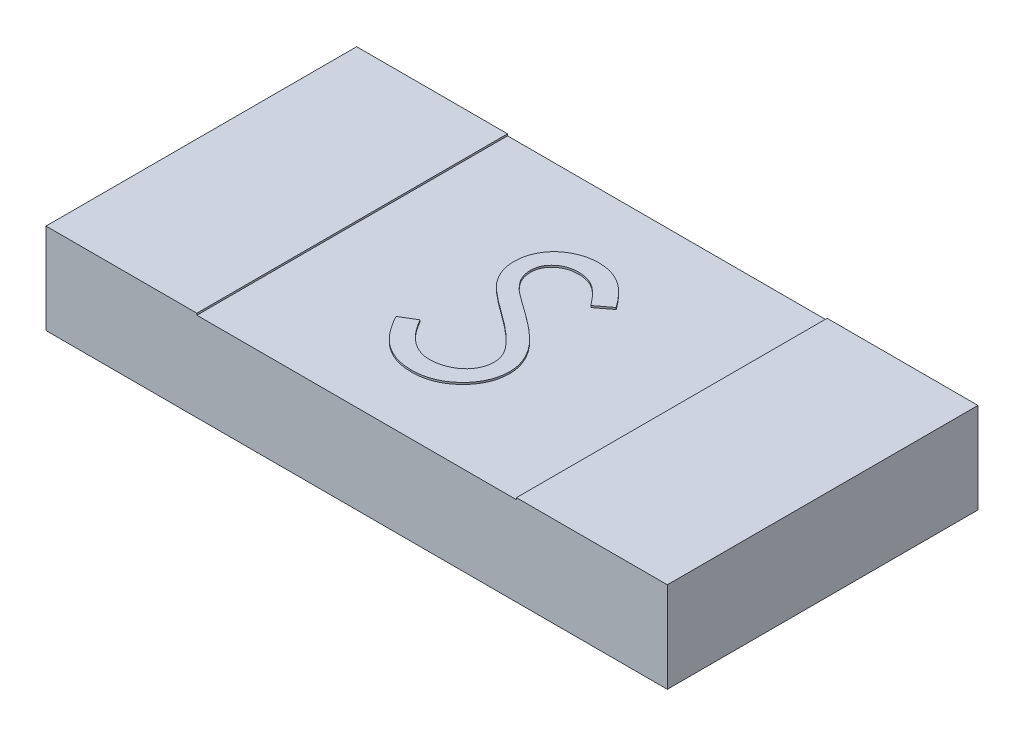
ISO-10303-21;
HEADER;
FILE_DESCRIPTION(('STEP AP214'),'2;1');
FILE_NAME('part.step','',(''),(''),'','','');
FILE_SCHEMA(('AUTOMOTIVE_DESIGN { 1 0 10303 214 1 1 1 1 }'));
ENDSEC;
DATA;
#1=APPLICATION_CONTEXT('core data for automotive mechanical design processes');
#2=APPLICATION_PROTOCOL_DEFINITION('international standard','automotive_design',2000,#1);
#3=PRODUCT_CONTEXT('',#1,'mechanical');
#4=PRODUCT('Part','Part','',(#3));
#5=PRODUCT_RELATED_PRODUCT_CATEGORY('part','',(#4));
#6=PRODUCT_DEFINITION_FORMATION('','',#4);
#7=PRODUCT_DEFINITION_CONTEXT('part definition',#1,'design');
#8=PRODUCT_DEFINITION('design','',#6,#7);
#9=PRODUCT_DEFINITION_SHAPE('','',#8);
#10=(LENGTH_UNIT() NAMED_UNIT(*) SI_UNIT(.MILLI.,.METRE.));
#11=(NAMED_UNIT(*) PLANE_ANGLE_UNIT() SI_UNIT($,.RADIAN.));
#12=(NAMED_UNIT(*) SI_UNIT($,.STERADIAN.) SOLID_ANGLE_UNIT());
#13=UNCERTAINTY_MEASURE_WITH_UNIT(LENGTH_MEASURE(1.E-05),#10,'distance_accuracy_value','');
#14=(GEOMETRIC_REPRESENTATION_CONTEXT(3) GLOBAL_UNCERTAINTY_ASSIGNED_CONTEXT((#13)) GLOBAL_UNIT_ASSIGNED_CONTEXT((#10,
#11,#12)) REPRESENTATION_CONTEXT('',''));
#15=CARTESIAN_POINT('',(0.,0.,0.));
#16=DIRECTION('',(0.,0.,1.));
#17=DIRECTION('',(1.,0.,0.));
#18=AXIS2_PLACEMENT_3D('',#15,#16,#17);
#19=CARTESIAN_POINT('',(0.,0.5,0.));
#20=DIRECTION('',(0.,1.,0.));
#21=DIRECTION('',(0.,0.,1.));
#22=AXIS2_PLACEMENT_3D('',#19,#20,#21);
#23=PLANE('',#22);
#24=CARTESIAN_POINT('',(-0.0194132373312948,0.5,0.548408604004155));
#25=CARTESIAN_POINT('',(-0.0269661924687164,0.5,0.54826255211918));
#26=CARTESIAN_POINT('',(-0.0419769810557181,0.5,0.547972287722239));
#27=CARTESIAN_POINT('',(-0.0641796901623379,0.5,0.545406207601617));
#28=CARTESIAN_POINT('',(-0.0859338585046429,0.5,0.541775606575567));
#29=CARTESIAN_POINT('',(-0.106966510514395,0.5,0.536011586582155));
#30=CARTESIAN_POINT('',(-0.127548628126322,0.5,0.529018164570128));
#31=CARTESIAN_POINT('',(-0.147590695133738,0.5,0.520407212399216));
#32=CARTESIAN_POINT('',(-0.167102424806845,0.5,0.510088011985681));
#33=CARTESIAN_POINT('',(-0.186193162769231,0.5,0.498289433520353));
#34=CARTESIAN_POINT('',(-0.204814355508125,0.5,0.484558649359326));
#35=CARTESIAN_POINT('',(-0.222791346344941,0.5,0.468566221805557));
#36=CARTESIAN_POINT('',(-0.24071397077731,0.5,0.450753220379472));
#37=CARTESIAN_POINT('',(-0.258053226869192,0.5,0.430635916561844));
#38=CARTESIAN_POINT('',(-0.275159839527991,0.5,0.408539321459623));
#39=CARTESIAN_POINT('',(-0.291696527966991,0.5,0.384256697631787));
#40=CARTESIAN_POINT('',(-0.308005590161,0.5,0.357920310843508));
#41=CARTESIAN_POINT('',(-0.318238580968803,0.5,0.339387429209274));
#42=CARTESIAN_POINT('',(-0.323499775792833,0.5,0.329858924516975));
#43=B_SPLINE_CURVE_WITH_KNOTS('',3,(#24,#25,#26,#27,#28,#29,#30,#31,#32,#33,#34,#35,#36,#37,#38,
#39,#40,#41,#42),.UNSPECIFIED.,.F.,.F.,(4,1,1,1,1,1,1,1,1,1,1,1,1,1,1,1,4),(0.,
0.0572082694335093,0.113696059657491,0.169177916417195,0.224159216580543,0.278719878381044,
0.333794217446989,0.389241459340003,0.445822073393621,0.50370428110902,0.564293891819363,
0.627975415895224,0.695038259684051,0.765372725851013,0.839611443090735,0.917537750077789,1.),.UNSPECIFIED.);
#44=CARTESIAN_POINT('',(-0.0194132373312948,0.5,0.548408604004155));
#45=VERTEX_POINT('',#44);
#46=CARTESIAN_POINT('',(-0.323499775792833,0.5,0.329858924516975));
#47=VERTEX_POINT('',#46);
#48=EDGE_CURVE('E492',#45,#47,#43,.T.);
#49=ORIENTED_EDGE('',*,*,#48,.T.);
#50=DIRECTION('',(0.857672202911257,0.,-0.514196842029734));
#51=VECTOR('',#50,1.);
#52=CARTESIAN_POINT('',(-0.323499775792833,0.5,0.329858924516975));
#53=LINE('',#52,#51);
#54=CARTESIAN_POINT('',(-0.238964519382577,0.5,0.279177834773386));
#55=VERTEX_POINT('',#54);
#56=EDGE_CURVE('E204',#47,#55,#53,.T.);
#57=ORIENTED_EDGE('',*,*,#56,.T.);
#58=CARTESIAN_POINT('',(-0.238964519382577,0.5,0.279177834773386));
#59=CARTESIAN_POINT('',(-0.231102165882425,0.5,0.292339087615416));
#60=CARTESIAN_POINT('',(-0.216038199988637,0.5,0.317555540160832));
#61=CARTESIAN_POINT('',(-0.190909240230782,0.5,0.351629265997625));
#62=CARTESIAN_POINT('',(-0.164871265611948,0.5,0.380589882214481));
#63=CARTESIAN_POINT('',(-0.137731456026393,0.5,0.404268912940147));
#64=CARTESIAN_POINT('',(-0.109655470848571,0.5,0.422911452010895));
#65=CARTESIAN_POINT('',(-0.0804600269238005,0.5,0.436112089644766));
#66=CARTESIAN_POINT('',(-0.050243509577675,0.5,0.444345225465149));
#67=CARTESIAN_POINT('',(-0.0296795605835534,0.5,0.445345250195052));
#68=CARTESIAN_POINT('',(-0.0194132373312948,0.5,0.445844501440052));
#69=B_SPLINE_CURVE_WITH_KNOTS('',3,(#58,#59,#60,#61,#62,#63,#64,#65,#66,#67,#68),.UNSPECIFIED.,
.F.,.F.,(4,1,1,1,1,1,1,1,4),(0.,0.159004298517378,0.304646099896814,0.438546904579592,
0.562322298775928,0.677432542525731,0.786897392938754,0.893610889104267,1.),.UNSPECIFIED.);
#70=CARTESIAN_POINT('',(-0.0194132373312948,0.5,0.445844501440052));
#71=VERTEX_POINT('',#70);
#72=EDGE_CURVE('E481',#55,#71,#69,.T.);
#73=ORIENTED_EDGE('',*,*,#72,.T.);
#74=CARTESIAN_POINT('',(-0.0194132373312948,0.5,0.445844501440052));
#75=CARTESIAN_POINT('',(-0.0106455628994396,0.5,0.445600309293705));
#76=CARTESIAN_POINT('',(0.00673637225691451,0.5,0.445116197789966));
#77=CARTESIAN_POINT('',(0.0323255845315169,0.5,0.440464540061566));
#78=CARTESIAN_POINT('',(0.0571775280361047,0.5,0.433318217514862));
#79=CARTESIAN_POINT('',(0.080779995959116,0.5,0.423083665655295));
#80=CARTESIAN_POINT('',(0.102807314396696,0.5,0.410701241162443));
#81=CARTESIAN_POINT('',(0.122123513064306,0.5,0.395745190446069));
#82=CARTESIAN_POINT('',(0.138822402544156,0.5,0.379000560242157));
#83=CARTESIAN_POINT('',(0.152482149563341,0.5,0.360319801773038));
#84=CARTESIAN_POINT('',(0.162962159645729,0.5,0.340229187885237));
#85=CARTESIAN_POINT('',(0.171017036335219,0.5,0.319607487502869));
#86=CARTESIAN_POINT('',(0.1754870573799,0.5,0.298130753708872));
#87=CARTESIAN_POINT('',(0.176160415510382,0.5,0.283670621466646));
#88=CARTESIAN_POINT('',(0.176500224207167,0.5,0.276373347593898));
#89=B_SPLINE_CURVE_WITH_KNOTS('',3,(#74,#75,#76,#77,#78,#79,#80,#81,#82,#83,#84,#85,#86,#87,
#88),.UNSPECIFIED.,.F.,.F.,(4,1,1,1,1,1,1,1,1,1,1,1,4),(0.,0.0912636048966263,0.180930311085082,
0.270088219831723,0.360156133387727,0.448342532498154,0.532665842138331,0.613833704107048,
0.693981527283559,0.772715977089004,0.849335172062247,0.923967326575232,1.),.UNSPECIFIED.);
#90=CARTESIAN_POINT('',(0.176500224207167,0.5,0.276373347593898));
#91=VERTEX_POINT('',#90);
#92=EDGE_CURVE('E474',#71,#91,#89,.T.);
#93=ORIENTED_EDGE('',*,*,#92,.T.);
#94=CARTESIAN_POINT('',(0.176500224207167,0.5,0.276373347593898));
#95=CARTESIAN_POINT('',(0.176078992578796,0.5,0.268047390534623));
#96=CARTESIAN_POINT('',(0.175222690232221,0.5,0.251121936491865));
#97=CARTESIAN_POINT('',(0.167985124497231,0.5,0.226150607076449));
#98=CARTESIAN_POINT('',(0.156599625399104,0.5,0.201438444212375));
#99=CARTESIAN_POINT('',(0.146096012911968,0.5,0.186152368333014));
#100=CARTESIAN_POINT('',(0.140642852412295,0.5,0.178216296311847));
#101=B_SPLINE_CURVE_WITH_KNOTS('',3,(#94,#95,#96,#97,#98,#99,#100),.UNSPECIFIED.,.F.,.F.,(4,1,1,
1,4),(0.,0.234723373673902,0.477158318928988,0.728556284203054,1.),.UNSPECIFIED.);
#102=CARTESIAN_POINT('',(0.140642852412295,0.5,0.178216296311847));
#103=VERTEX_POINT('',#102);
#104=EDGE_CURVE('E467',#91,#103,#101,.T.);
#105=ORIENTED_EDGE('',*,*,#104,.T.);
#106=CARTESIAN_POINT('',(0.140642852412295,0.5,0.178216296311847));
#107=CARTESIAN_POINT('',(0.136165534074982,0.5,0.172488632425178));
#108=CARTESIAN_POINT('',(0.126765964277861,0.5,0.160464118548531));
#109=CARTESIAN_POINT('',(0.110606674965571,0.5,0.142565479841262));
#110=CARTESIAN_POINT('',(0.0916449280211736,0.5,0.12410307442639));
#111=CARTESIAN_POINT('',(0.07052962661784,0.5,0.104371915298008));
#112=CARTESIAN_POINT('',(0.0464916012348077,0.5,0.084289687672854));
#113=CARTESIAN_POINT('',(0.0202837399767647,0.5,0.0628987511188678));
#114=CARTESIAN_POINT('',(-0.00876307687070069,0.5,0.041012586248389));
#115=CARTESIAN_POINT('',(-0.0291343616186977,0.5,0.0263347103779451));
#116=CARTESIAN_POINT('',(-0.0396456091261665,0.5,0.0187611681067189));
#117=B_SPLINE_CURVE_WITH_KNOTS('',3,(#106,#107,#108,#109,#110,#111,#112,#113,#114,#115,#116),
.UNSPECIFIED.,.F.,.F.,(4,1,1,1,1,1,1,1,4),(0.,0.0902792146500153,0.189529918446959,
0.299197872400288,0.41892588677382,0.548376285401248,0.688136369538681,0.83908350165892,1.),.UNSPECIFIED.);
#118=CARTESIAN_POINT('',(-0.0396456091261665,0.5,0.0187611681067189));
#119=VERTEX_POINT('',#118);
#120=EDGE_CURVE('E460',#103,#119,#117,.T.);
#121=ORIENTED_EDGE('',*,*,#120,.T.);
#122=CARTESIAN_POINT('',(-0.0396456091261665,0.5,0.0187611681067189));
#123=CARTESIAN_POINT('',(-0.0501667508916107,0.5,0.0112672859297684));
#124=CARTESIAN_POINT('',(-0.070282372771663,0.5,-0.00306044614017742));
#125=CARTESIAN_POINT('',(-0.0984133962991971,0.5,-0.0243245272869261));
#126=CARTESIAN_POINT('',(-0.123568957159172,0.5,-0.0437656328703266));
#127=CARTESIAN_POINT('',(-0.145637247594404,0.5,-0.0615667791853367));
#128=CARTESIAN_POINT('',(-0.164608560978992,0.5,-0.07773038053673));
#129=CARTESIAN_POINT('',(-0.180632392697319,0.5,-0.0921012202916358));
#130=CARTESIAN_POINT('',(-0.193300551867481,0.5,-0.105067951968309));
#131=CARTESIAN_POINT('',(-0.200345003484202,0.5,-0.113479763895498));
#132=CARTESIAN_POINT('',(-0.203507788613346,0.5,-0.117256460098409));
#133=B_SPLINE_CURVE_WITH_KNOTS('',3,(#122,#123,#124,#125,#126,#127,#128,#129,#130,#131,#132),
.UNSPECIFIED.,.F.,.F.,(4,1,1,1,1,1,1,1,4),(0.,0.181535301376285,0.347081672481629,
0.495567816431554,0.628357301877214,0.745519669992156,0.845830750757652,0.930781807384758,1.),.UNSPECIFIED.);
#134=CARTESIAN_POINT('',(-0.203507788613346,0.5,-0.117256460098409));
#135=VERTEX_POINT('',#134);
#136=EDGE_CURVE('E453',#119,#135,#133,.T.);
#137=ORIENTED_EDGE('',*,*,#136,.T.);
#138=CARTESIAN_POINT('',(-0.203507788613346,0.5,-0.117256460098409));
#139=CARTESIAN_POINT('',(-0.207928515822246,0.5,-0.123142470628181));
#140=CARTESIAN_POINT('',(-0.216622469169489,0.5,-0.134718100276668));
#141=CARTESIAN_POINT('',(-0.228098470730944,0.5,-0.152810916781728));
#142=CARTESIAN_POINT('',(-0.237852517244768,0.5,-0.171331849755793));
#143=CARTESIAN_POINT('',(-0.245498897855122,0.5,-0.190330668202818));
#144=CARTESIAN_POINT('',(-0.251937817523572,0.5,-0.209540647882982));
#145=CARTESIAN_POINT('',(-0.256268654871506,0.5,-0.229212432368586));
#146=CARTESIAN_POINT('',(-0.25898048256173,0.5,-0.249257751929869));
#147=CARTESIAN_POINT('',(-0.25925819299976,0.5,-0.2627473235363));
#148=CARTESIAN_POINT('',(-0.259397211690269,0.5,-0.269500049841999));
#149=B_SPLINE_CURVE_WITH_KNOTS('',3,(#138,#139,#140,#141,#142,#143,#144,#145,#146,#147,#148),
.UNSPECIFIED.,.F.,.F.,(4,1,1,1,1,1,1,1,4),(0.,0.133506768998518,0.26255897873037,
0.388264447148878,0.512667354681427,0.63372226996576,0.755393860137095,0.877552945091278,1.),.UNSPECIFIED.);
#150=CARTESIAN_POINT('',(-0.259397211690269,0.5,-0.269500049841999));
#151=VERTEX_POINT('',#150);
#152=EDGE_CURVE('E446',#135,#151,#149,.T.);
#153=ORIENTED_EDGE('',*,*,#152,.T.);
#154=CARTESIAN_POINT('',(-0.259397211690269,0.5,-0.269500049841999));
#155=CARTESIAN_POINT('',(-0.259024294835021,0.5,-0.280079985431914));
#156=CARTESIAN_POINT('',(-0.258286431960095,0.5,-0.301013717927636));
#157=CARTESIAN_POINT('',(-0.252046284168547,0.5,-0.331593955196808));
#158=CARTESIAN_POINT('',(-0.242196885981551,0.5,-0.360790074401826));
#159=CARTESIAN_POINT('',(-0.228398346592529,0.5,-0.388313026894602));
#160=CARTESIAN_POINT('',(-0.210610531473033,0.5,-0.413446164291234));
#161=CARTESIAN_POINT('',(-0.190025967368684,0.5,-0.436478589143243));
#162=CARTESIAN_POINT('',(-0.165508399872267,0.5,-0.455841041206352));
#163=CARTESIAN_POINT('',(-0.138607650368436,0.5,-0.472758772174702));
#164=CARTESIAN_POINT('',(-0.109162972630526,0.5,-0.486000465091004));
#165=CARTESIAN_POINT('',(-0.0783084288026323,0.5,-0.495989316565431));
#166=CARTESIAN_POINT('',(-0.0459949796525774,0.5,-0.501649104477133));
#167=CARTESIAN_POINT('',(-0.0241083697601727,0.5,-0.502461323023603));
#168=CARTESIAN_POINT('',(-0.0130029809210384,0.5,-0.502873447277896));
#169=B_SPLINE_CURVE_WITH_KNOTS('',3,(#154,#155,#156,#157,#158,#159,#160,#161,#162,#163,#164,
#165,#166,#167,#168),.UNSPECIFIED.,.F.,.F.,(4,1,1,1,1,1,1,1,1,1,1,1,4),(0.,0.08378537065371,
0.165779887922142,0.246280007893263,0.32746092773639,0.408796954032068,0.489715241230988,
0.571376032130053,0.655523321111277,0.741019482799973,0.826546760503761,0.911988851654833,1.),.UNSPECIFIED.);
#170=CARTESIAN_POINT('',(-0.0130029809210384,0.5,-0.502873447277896));
#171=VERTEX_POINT('',#170);
#172=EDGE_CURVE('E439',#151,#171,#169,.T.);
#173=ORIENTED_EDGE('',*,*,#172,.T.);
#174=CARTESIAN_POINT('',(-0.0130029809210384,0.5,-0.502873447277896));
#175=CARTESIAN_POINT('',(-0.0012189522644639,0.5,-0.502467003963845));
#176=CARTESIAN_POINT('',(0.0222157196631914,0.5,-0.501658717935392));
#177=CARTESIAN_POINT('',(0.0566869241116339,0.5,-0.494630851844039));
#178=CARTESIAN_POINT('',(0.0898757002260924,0.5,-0.483002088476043));
#179=CARTESIAN_POINT('',(0.116573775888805,0.5,-0.469805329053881));
#180=CARTESIAN_POINT('',(0.137468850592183,0.5,-0.456624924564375));
#181=CARTESIAN_POINT('',(0.153403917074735,0.5,-0.444619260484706));
#182=CARTESIAN_POINT('',(0.169551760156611,0.5,-0.430797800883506));
#183=CARTESIAN_POINT('',(0.186042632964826,0.5,-0.415123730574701));
#184=CARTESIAN_POINT('',(0.202597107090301,0.5,-0.397453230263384));
#185=CARTESIAN_POINT('',(0.219460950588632,0.5,-0.377907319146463));
#186=CARTESIAN_POINT('',(0.236673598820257,0.5,-0.356605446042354));
#187=CARTESIAN_POINT('',(0.247746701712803,0.5,-0.341398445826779));
#188=CARTESIAN_POINT('',(0.253423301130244,0.5,-0.333602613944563));
#189=B_SPLINE_CURVE_WITH_KNOTS('',3,(#174,#175,#176,#177,#178,#179,#180,#181,#182,#183,#184,
#185,#186,#187,#188),.UNSPECIFIED.,.F.,.F.,(4,1,1,1,1,1,1,1,1,1,1,1,4),(0.,0.107232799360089,
0.213251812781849,0.318830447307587,0.426793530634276,0.483645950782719,0.543603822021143,
0.608307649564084,0.677126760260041,0.750685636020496,0.828713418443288,0.912190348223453,1.),.UNSPECIFIED.);
#190=CARTESIAN_POINT('',(0.253423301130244,0.5,-0.333602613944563));
#191=VERTEX_POINT('',#190);
#192=EDGE_CURVE('E435',#171,#191,#189,.T.);
#193=ORIENTED_EDGE('',*,*,#192,.T.);
#194=DIRECTION('',(-0.796919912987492,0.,0.604084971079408));
#195=VECTOR('',#194,1.);
#196=CARTESIAN_POINT('',(0.253423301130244,0.5,-0.333602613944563));
#197=LINE('',#196,#195);
#198=CARTESIAN_POINT('',(0.172293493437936,0.5,-0.272104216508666));
#199=VERTEX_POINT('',#198);
#200=EDGE_CURVE('E430',#191,#199,#197,.T.);
#201=ORIENTED_EDGE('',*,*,#200,.T.);
#202=CARTESIAN_POINT('',(0.172293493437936,0.5,-0.272104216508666));
#203=CARTESIAN_POINT('',(0.167394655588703,0.5,-0.278415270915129));
#204=CARTESIAN_POINT('',(0.157960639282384,0.5,-0.290568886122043));
#205=CARTESIAN_POINT('',(0.143637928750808,0.5,-0.307589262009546));
#206=CARTESIAN_POINT('',(0.1301383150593,0.5,-0.323136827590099));
#207=CARTESIAN_POINT('',(0.116838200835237,0.5,-0.336641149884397));
#208=CARTESIAN_POINT('',(0.104440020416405,0.5,-0.348841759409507));
#209=CARTESIAN_POINT('',(0.0924065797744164,0.5,-0.359287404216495));
#210=CARTESIAN_POINT('',(0.0809110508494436,0.5,-0.368080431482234));
#211=CARTESIAN_POINT('',(0.066420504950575,0.5,-0.377464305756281));
#212=CARTESIAN_POINT('',(0.04821544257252,0.5,-0.386766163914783));
#213=CARTESIAN_POINT('',(0.0253627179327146,0.5,-0.394637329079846));
#214=CARTESIAN_POINT('',(0.00148092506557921,0.5,-0.399367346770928));
#215=CARTESIAN_POINT('',(-0.0147846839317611,0.5,-0.399992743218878));
#216=CARTESIAN_POINT('',(-0.023019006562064,0.5,-0.400309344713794));
#217=B_SPLINE_CURVE_WITH_KNOTS('',3,(#202,#203,#204,#205,#206,#207,#208,#209,#210,#211,#212,
#213,#214,#215,#216),.UNSPECIFIED.,.F.,.F.,(4,1,1,1,1,1,1,1,1,1,1,1,4),(0.,0.098469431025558,
0.189629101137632,0.27418408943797,0.352183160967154,0.42319887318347,0.488550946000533,
0.548473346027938,0.601440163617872,0.701198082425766,0.799591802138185,0.898545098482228,1.),.UNSPECIFIED.);
#218=CARTESIAN_POINT('',(-0.023019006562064,0.5,-0.400309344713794));
#219=VERTEX_POINT('',#218);
#220=EDGE_CURVE('E423',#199,#219,#217,.T.);
#221=ORIENTED_EDGE('',*,*,#220,.T.);
#222=CARTESIAN_POINT('',(-0.023019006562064,0.5,-0.400309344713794));
#223=CARTESIAN_POINT('',(-0.033349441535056,0.5,-0.39996314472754));
#224=CARTESIAN_POINT('',(-0.0532707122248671,0.5,-0.399295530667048));
#225=CARTESIAN_POINT('',(-0.0815536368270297,0.5,-0.392004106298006));
#226=CARTESIAN_POINT('',(-0.107009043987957,0.5,-0.380523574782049));
#227=CARTESIAN_POINT('',(-0.128881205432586,0.5,-0.364433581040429));
#228=CARTESIAN_POINT('',(-0.147091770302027,0.5,-0.345370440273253));
#229=CARTESIAN_POINT('',(-0.160264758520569,0.5,-0.323433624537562));
#230=CARTESIAN_POINT('',(-0.168193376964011,0.5,-0.299210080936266));
#231=CARTESIAN_POINT('',(-0.169160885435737,0.5,-0.282312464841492));
#232=CARTESIAN_POINT('',(-0.169653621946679,0.5,-0.27370678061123));
#233=B_SPLINE_CURVE_WITH_KNOTS('',3,(#222,#223,#224,#225,#226,#227,#228,#229,#230,#231,#232),
.UNSPECIFIED.,.F.,.F.,(4,1,1,1,1,1,1,1,4),(0.,0.143073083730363,0.27590296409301,
0.402370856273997,0.528413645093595,0.650356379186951,0.765895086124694,0.880774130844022,1.),.UNSPECIFIED.);
#234=CARTESIAN_POINT('',(-0.169653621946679,0.5,-0.27370678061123));
#235=VERTEX_POINT('',#234);
#236=EDGE_CURVE('E416',#219,#235,#233,.T.);
#237=ORIENTED_EDGE('',*,*,#236,.T.);
#238=CARTESIAN_POINT('',(-0.169653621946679,0.5,-0.27370678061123));
#239=CARTESIAN_POINT('',(-0.169541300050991,0.5,-0.268349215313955));
#240=CARTESIAN_POINT('',(-0.169316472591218,0.5,-0.257625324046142));
#241=CARTESIAN_POINT('',(-0.166180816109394,0.5,-0.241782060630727));
#242=CARTESIAN_POINT('',(-0.162152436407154,0.5,-0.225978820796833));
#243=CARTESIAN_POINT('',(-0.155768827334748,0.5,-0.210286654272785));
#244=CARTESIAN_POINT('',(-0.146955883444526,0.5,-0.194431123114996));
#245=CARTESIAN_POINT('',(-0.135382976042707,0.5,-0.178139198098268));
#246=CARTESIAN_POINT('',(-0.120807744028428,0.5,-0.161267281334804));
#247=CARTESIAN_POINT('',(-0.109642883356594,0.5,-0.150293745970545));
#248=CARTESIAN_POINT('',(-0.103748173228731,0.5,-0.144500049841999));
#249=B_SPLINE_CURVE_WITH_KNOTS('',3,(#238,#239,#240,#241,#242,#243,#244,#245,#246,#247,#248),
.UNSPECIFIED.,.F.,.F.,(4,1,1,1,1,1,1,1,4),(0.,0.107285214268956,0.21474586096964,
0.322938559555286,0.434116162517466,0.553412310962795,0.68607298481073,0.834255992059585,1.),.UNSPECIFIED.);
#250=CARTESIAN_POINT('',(-0.103748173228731,0.5,-0.144500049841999));
#251=VERTEX_POINT('',#250);
#252=EDGE_CURVE('E409',#235,#251,#249,.T.);
#253=ORIENTED_EDGE('',*,*,#252,.T.);
#254=CARTESIAN_POINT('',(-0.103748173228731,0.5,-0.144500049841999));
#255=CARTESIAN_POINT('',(-0.101559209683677,0.5,-0.142546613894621));
#256=CARTESIAN_POINT('',(-0.0963587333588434,0.5,-0.137905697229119));
#257=CARTESIAN_POINT('',(-0.0868513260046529,0.5,-0.130307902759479));
#258=CARTESIAN_POINT('',(-0.0742962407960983,0.5,-0.120935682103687));
#259=CARTESIAN_POINT('',(-0.0590213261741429,0.5,-0.109339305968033));
#260=CARTESIAN_POINT('',(-0.0407449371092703,0.5,-0.0958874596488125));
#261=CARTESIAN_POINT('',(-0.0194650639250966,0.5,-0.0807521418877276));
#262=CARTESIAN_POINT('',(0.00458108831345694,0.5,-0.0634420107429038));
#263=CARTESIAN_POINT('',(0.0216444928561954,0.5,-0.0513398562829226));
#264=CARTESIAN_POINT('',(0.0306668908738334,0.5,-0.0449407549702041));
#265=B_SPLINE_CURVE_WITH_KNOTS('',3,(#254,#255,#256,#257,#258,#259,#260,#261,#262,#263,#264),
.UNSPECIFIED.,.F.,.F.,(4,1,1,1,1,1,1,1,4),(0.,0.052594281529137,0.124951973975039,
0.218093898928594,0.333502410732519,0.468789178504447,0.624937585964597,0.801683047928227,1.),.UNSPECIFIED.);
#266=CARTESIAN_POINT('',(0.0306668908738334,0.5,-0.0449407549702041));
#267=VERTEX_POINT('',#266);
#268=EDGE_CURVE('E402',#251,#267,#265,.T.);
#269=ORIENTED_EDGE('',*,*,#268,.T.);
#270=CARTESIAN_POINT('',(0.0306668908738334,0.5,-0.0449407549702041));
#271=CARTESIAN_POINT('',(0.0415200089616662,0.5,-0.0370432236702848));
#272=CARTESIAN_POINT('',(0.0625355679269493,0.5,-0.0217507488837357));
#273=CARTESIAN_POINT('',(0.0924377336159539,0.5,0.0012251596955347));
#274=CARTESIAN_POINT('',(0.119550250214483,0.5,0.0236959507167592));
#275=CARTESIAN_POINT('',(0.143968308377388,0.5,0.0455181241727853));
#276=CARTESIAN_POINT('',(0.16593313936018,0.5,0.0665261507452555));
#277=CARTESIAN_POINT('',(0.185201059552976,0.5,0.0869727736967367));
#278=CARTESIAN_POINT('',(0.201968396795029,0.5,0.1067115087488));
#279=CARTESIAN_POINT('',(0.220019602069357,0.5,0.132017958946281));
#280=CARTESIAN_POINT('',(0.238464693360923,0.5,0.16309826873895));
#281=CARTESIAN_POINT('',(0.254305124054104,0.5,0.201177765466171));
#282=CARTESIAN_POINT('',(0.264293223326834,0.5,0.239405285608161));
#283=CARTESIAN_POINT('',(0.265599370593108,0.5,0.265098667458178));
#284=CARTESIAN_POINT('',(0.266243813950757,0.5,0.277775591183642));
#285=B_SPLINE_CURVE_WITH_KNOTS('',3,(#270,#271,#272,#273,#274,#275,#276,#277,#278,#279,#280,
#281,#282,#283,#284),.UNSPECIFIED.,.F.,.F.,(4,1,1,1,1,1,1,1,1,1,1,1,4),(0.,0.0969723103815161,
0.187773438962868,0.272396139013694,0.351320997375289,0.424334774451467,0.491908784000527,
0.554233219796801,0.611267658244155,0.716347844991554,0.814540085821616,0.908495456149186,1.),.UNSPECIFIED.);
#286=CARTESIAN_POINT('',(0.266243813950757,0.5,0.277775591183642));
#287=VERTEX_POINT('',#286);
#288=EDGE_CURVE('E52',#267,#287,#285,.T.);
#289=ORIENTED_EDGE('',*,*,#288,.T.);
#290=CARTESIAN_POINT('',(0.266243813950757,0.5,0.277775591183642));
#291=CARTESIAN_POINT('',(0.266056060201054,0.5,0.286740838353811));
#292=CARTESIAN_POINT('',(0.265684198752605,0.5,0.30449723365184));
#293=CARTESIAN_POINT('',(0.261409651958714,0.5,0.330570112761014));
#294=CARTESIAN_POINT('',(0.255146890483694,0.5,0.355893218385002));
#295=CARTESIAN_POINT('',(0.245707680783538,0.5,0.380153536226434));
#296=CARTESIAN_POINT('',(0.234186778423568,0.5,0.403794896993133));
#297=CARTESIAN_POINT('',(0.219567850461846,0.5,0.426197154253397));
#298=CARTESIAN_POINT('',(0.202622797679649,0.5,0.447856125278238));
#299=CARTESIAN_POINT('',(0.183184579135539,0.5,0.468194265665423));
#300=CARTESIAN_POINT('',(0.161914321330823,0.5,0.48686460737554));
#301=CARTESIAN_POINT('',(0.139433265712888,0.5,0.503472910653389));
#302=CARTESIAN_POINT('',(0.11570461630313,0.5,0.517321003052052));
#303=CARTESIAN_POINT('',(0.0908570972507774,0.5,0.528621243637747));
#304=CARTESIAN_POINT('',(0.0648850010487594,0.5,0.53745939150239));
#305=CARTESIAN_POINT('',(0.0377970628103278,0.5,0.543863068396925));
#306=CARTESIAN_POINT('',(0.0095486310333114,0.5,0.547793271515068));
#307=CARTESIAN_POINT('',(-0.00965150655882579,0.5,0.548201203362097));
#308=CARTESIAN_POINT('',(-0.0194132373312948,0.5,0.548408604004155));
#309=B_SPLINE_CURVE_WITH_KNOTS('',3,(#290,#291,#292,#293,#294,#295,#296,#297,#298,#299,#300,
#301,#302,#303,#304,#305,#306,#307,#308),.UNSPECIFIED.,.F.,.F.,(4,1,1,1,1,1,1,1,1,1,1,1,1,1,1,1,
4),(0.,0.0614842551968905,0.12177452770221,0.180919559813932,0.240256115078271,
0.300114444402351,0.361145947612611,0.423500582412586,0.488669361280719,0.553954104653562,
0.617581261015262,0.680238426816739,0.742187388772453,0.804663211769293,0.868258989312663,
0.933020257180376,1.),.UNSPECIFIED.);
#310=EDGE_CURVE('E47',#287,#45,#309,.T.);
#311=ORIENTED_EDGE('',*,*,#310,.T.);
#312=EDGE_LOOP('',(#49,#57,#73,#93,#105,#121,#137,#153,#173,#193,#201,#221,#237,#253,#269,#289,#311));
#313=FACE_BOUND('',#312,.T.);
#314=DIRECTION('',(1.,0.,0.));
#315=VECTOR('',#314,1.);
#316=CARTESIAN_POINT('',(1.75,0.5,0.875));
#317=LINE('',#316,#315);
#318=CARTESIAN_POINT('',(-0.9,0.5,0.875000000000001));
#319=VERTEX_POINT('',#318);
#320=CARTESIAN_POINT('',(0.9,0.5,0.875));
#321=VERTEX_POINT('',#320);
#322=EDGE_CURVE('E294',#319,#321,#317,.T.);
#323=ORIENTED_EDGE('',*,*,#322,.T.);
#324=DIRECTION('',(0.,0.,1.));
#325=VECTOR('',#324,1.);
#326=CARTESIAN_POINT('',(0.9,0.5,-0.875));
#327=LINE('',#326,#325);
#328=CARTESIAN_POINT('',(0.9,0.5,-0.875));
#329=VERTEX_POINT('',#328);
#330=EDGE_CURVE('E316',#329,#321,#327,.T.);
#331=ORIENTED_EDGE('',*,*,#330,.F.);
#332=DIRECTION('',(-1.,0.,0.));
#333=VECTOR('',#332,1.);
#334=CARTESIAN_POINT('',(1.75,0.5,-0.875));
#335=LINE('',#334,#333);
#336=CARTESIAN_POINT('',(-0.9,0.5,-0.875));
#337=VERTEX_POINT('',#336);
#338=EDGE_CURVE('E301',#329,#337,#335,.T.);
#339=ORIENTED_EDGE('',*,*,#338,.T.);
#340=DIRECTION('',(0.,0.,-1.));
#341=VECTOR('',#340,1.);
#342=CARTESIAN_POINT('',(-0.9,0.5,-0.875));
#343=LINE('',#342,#341);
#344=EDGE_CURVE('E321',#319,#337,#343,.T.);
#345=ORIENTED_EDGE('',*,*,#344,.F.);
#346=EDGE_LOOP('',(#323,#331,#339,#345));
#347=FACE_BOUND('',#346,.T.);
#348=ADVANCED_FACE('F32',(#313,#347),#23,.T.);
#349=CARTESIAN_POINT('',(-1.75,0.5,0.875000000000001));
#350=DIRECTION('',(1.,0.,0.));
#351=DIRECTION('',(0.,0.,-1.));
#352=AXIS2_PLACEMENT_3D('',#349,#350,#351);
#353=PLANE('',#352);
#354=DIRECTION('',(0.,0.,1.));
#355=VECTOR('',#354,1.);
#356=CARTESIAN_POINT('',(-1.75,0.,0.875000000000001));
#357=LINE('',#356,#355);
#358=CARTESIAN_POINT('',(-1.75,0.,-0.875));
#359=VERTEX_POINT('',#358);
#360=CARTESIAN_POINT('',(-1.75,0.,0.875000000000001));
#361=VERTEX_POINT('',#360);
#362=EDGE_CURVE('E284',#359,#361,#357,.T.);
#363=ORIENTED_EDGE('',*,*,#362,.T.);
#364=DIRECTION('',(0.,-1.,0.));
#365=VECTOR('',#364,1.);
#366=CARTESIAN_POINT('',(-1.75,0.5,0.875000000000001));
#367=LINE('',#366,#365);
#368=CARTESIAN_POINT('',(-1.75,0.51,0.875000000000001));
#369=VERTEX_POINT('',#368);
#370=EDGE_CURVE('E11',#369,#361,#367,.T.);
#371=ORIENTED_EDGE('',*,*,#370,.F.);
#372=DIRECTION('',(0.,0.,1.));
#373=VECTOR('',#372,1.);
#374=CARTESIAN_POINT('',(-1.75,0.51,-0.875));
#375=LINE('',#374,#373);
#376=CARTESIAN_POINT('',(-1.75,0.51,-0.875));
#377=VERTEX_POINT('',#376);
#378=EDGE_CURVE('E322',#377,#369,#375,.T.);
#379=ORIENTED_EDGE('',*,*,#378,.F.);
#380=DIRECTION('',(0.,-1.,0.));
#381=VECTOR('',#380,1.);
#382=CARTESIAN_POINT('',(-1.75,0.5,-0.875));
#383=LINE('',#382,#381);
#384=EDGE_CURVE('E298',#377,#359,#383,.T.);
#385=ORIENTED_EDGE('',*,*,#384,.T.);
#386=EDGE_LOOP('',(#363,#371,#379,#385));
#387=FACE_BOUND('',#386,.T.);
#388=ADVANCED_FACE('F34',(#387),#353,.F.);
#389=CARTESIAN_POINT('',(1.75,0.5,0.875));
#390=DIRECTION('',(0.,0.,-1.));
#391=DIRECTION('',(-1.,0.,0.));
#392=AXIS2_PLACEMENT_3D('',#389,#390,#391);
#393=PLANE('',#392);
#394=DIRECTION('',(1.,0.,0.));
#395=VECTOR('',#394,1.);
#396=CARTESIAN_POINT('',(1.75,0.,0.875));
#397=LINE('',#396,#395);
#398=CARTESIAN_POINT('',(1.75,0.,0.875));
#399=VERTEX_POINT('',#398);
#400=EDGE_CURVE('E275',#361,#399,#397,.T.);
#401=ORIENTED_EDGE('',*,*,#400,.T.);
#402=DIRECTION('',(0.,-1.,0.));
#403=VECTOR('',#402,1.);
#404=CARTESIAN_POINT('',(1.75,0.5,0.875));
#405=LINE('',#404,#403);
#406=CARTESIAN_POINT('',(1.75,0.51,0.875000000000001));
#407=VERTEX_POINT('',#406);
#408=EDGE_CURVE('E40',#407,#399,#405,.T.);
#409=ORIENTED_EDGE('',*,*,#408,.F.);
#410=DIRECTION('',(1.,0.,0.));
#411=VECTOR('',#410,1.);
#412=CARTESIAN_POINT('',(1.75,0.51,0.875000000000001));
#413=LINE('',#412,#411);
#414=CARTESIAN_POINT('',(0.9,0.51,0.875000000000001));
#415=VERTEX_POINT('',#414);
#416=EDGE_CURVE('E306',#415,#407,#413,.T.);
#417=ORIENTED_EDGE('',*,*,#416,.F.);
#418=DIRECTION('',(0.,-1.,0.));
#419=VECTOR('',#418,1.);
#420=CARTESIAN_POINT('',(0.9,0.51,0.875000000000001));
#421=LINE('',#420,#419);
#422=EDGE_CURVE('E307',#415,#321,#421,.T.);
#423=ORIENTED_EDGE('',*,*,#422,.T.);
#424=ORIENTED_EDGE('',*,*,#322,.F.);
#425=DIRECTION('',(0.,-1.,0.));
#426=VECTOR('',#425,1.);
#427=CARTESIAN_POINT('',(-0.899999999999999,0.51,0.875000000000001));
#428=LINE('',#427,#426);
#429=CARTESIAN_POINT('',(-0.899999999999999,0.51,0.875000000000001));
#430=VERTEX_POINT('',#429);
#431=EDGE_CURVE('E337',#430,#319,#428,.T.);
#432=ORIENTED_EDGE('',*,*,#431,.F.);
#433=DIRECTION('',(1.,0.,0.));
#434=VECTOR('',#433,1.);
#435=CARTESIAN_POINT('',(-1.75,0.51,0.875000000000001));
#436=LINE('',#435,#434);
#437=EDGE_CURVE('E325',#369,#430,#436,.T.);
#438=ORIENTED_EDGE('',*,*,#437,.F.);
#439=ORIENTED_EDGE('',*,*,#370,.T.);
#440=EDGE_LOOP('',(#401,#409,#417,#423,#424,#432,#438,#439));
#441=FACE_BOUND('',#440,.T.);
#442=ADVANCED_FACE('F267',(#441),#393,.F.);
#443=CARTESIAN_POINT('',(1.75,0.5,0.875));
#444=DIRECTION('',(-1.,0.,0.));
#445=DIRECTION('',(0.,0.,1.));
#446=AXIS2_PLACEMENT_3D('',#443,#444,#445);
#447=PLANE('',#446);
#448=DIRECTION('',(0.,0.,-1.));
#449=VECTOR('',#448,1.);
#450=CARTESIAN_POINT('',(1.75,0.,0.875));
#451=LINE('',#450,#449);
#452=CARTESIAN_POINT('',(1.75,0.,-0.875));
#453=VERTEX_POINT('',#452);
#454=EDGE_CURVE('E283',#399,#453,#451,.T.);
#455=ORIENTED_EDGE('',*,*,#454,.T.);
#456=DIRECTION('',(0.,-1.,0.));
#457=VECTOR('',#456,1.);
#458=CARTESIAN_POINT('',(1.75,0.5,-0.875));
#459=LINE('',#458,#457);
#460=CARTESIAN_POINT('',(1.75,0.51,-0.875));
#461=VERTEX_POINT('',#460);
#462=EDGE_CURVE('E290',#461,#453,#459,.T.);
#463=ORIENTED_EDGE('',*,*,#462,.F.);
#464=DIRECTION('',(0.,0.,-1.));
#465=VECTOR('',#464,1.);
#466=CARTESIAN_POINT('',(1.75,0.51,-0.875));
#467=LINE('',#466,#465);
#468=EDGE_CURVE('E289',#407,#461,#467,.T.);
#469=ORIENTED_EDGE('',*,*,#468,.F.);
#470=ORIENTED_EDGE('',*,*,#408,.T.);
#471=EDGE_LOOP('',(#455,#463,#469,#470));
#472=FACE_BOUND('',#471,.T.);
#473=ADVANCED_FACE('F264',(#472),#447,.F.);
#474=CARTESIAN_POINT('',(1.75,0.5,-0.875));
#475=DIRECTION('',(0.,0.,1.));
#476=DIRECTION('',(1.,0.,0.));
#477=AXIS2_PLACEMENT_3D('',#474,#475,#476);
#478=PLANE('',#477);
#479=DIRECTION('',(-1.,0.,0.));
#480=VECTOR('',#479,1.);
#481=CARTESIAN_POINT('',(1.75,0.,-0.875));
#482=LINE('',#481,#480);
#483=EDGE_CURVE('E292',#453,#359,#482,.T.);
#484=ORIENTED_EDGE('',*,*,#483,.T.);
#485=ORIENTED_EDGE('',*,*,#384,.F.);
#486=DIRECTION('',(-1.,0.,0.));
#487=VECTOR('',#486,1.);
#488=CARTESIAN_POINT('',(-1.75,0.51,-0.875));
#489=LINE('',#488,#487);
#490=CARTESIAN_POINT('',(-0.9,0.51,-0.875));
#491=VERTEX_POINT('',#490);
#492=EDGE_CURVE('E329',#491,#377,#489,.T.);
#493=ORIENTED_EDGE('',*,*,#492,.F.);
#494=DIRECTION('',(0.,-1.,0.));
#495=VECTOR('',#494,1.);
#496=CARTESIAN_POINT('',(-0.9,0.51,-0.875));
#497=LINE('',#496,#495);
#498=EDGE_CURVE('E332',#491,#337,#497,.T.);
#499=ORIENTED_EDGE('',*,*,#498,.T.);
#500=ORIENTED_EDGE('',*,*,#338,.F.);
#501=DIRECTION('',(0.,-1.,0.));
#502=VECTOR('',#501,1.);
#503=CARTESIAN_POINT('',(0.9,0.51,-0.875));
#504=LINE('',#503,#502);
#505=CARTESIAN_POINT('',(0.9,0.51,-0.875));
#506=VERTEX_POINT('',#505);
#507=EDGE_CURVE('E310',#506,#329,#504,.T.);
#508=ORIENTED_EDGE('',*,*,#507,.F.);
#509=DIRECTION('',(-1.,0.,0.));
#510=VECTOR('',#509,1.);
#511=CARTESIAN_POINT('',(1.75,0.51,-0.875));
#512=LINE('',#511,#510);
#513=EDGE_CURVE('E305',#461,#506,#512,.T.);
#514=ORIENTED_EDGE('',*,*,#513,.F.);
#515=ORIENTED_EDGE('',*,*,#462,.T.);
#516=EDGE_LOOP('',(#484,#485,#493,#499,#500,#508,#514,#515));
#517=FACE_BOUND('',#516,.T.);
#518=ADVANCED_FACE('F260',(#517),#478,.F.);
#519=CARTESIAN_POINT('',(0.,0.,0.));
#520=DIRECTION('',(0.,1.,0.));
#521=DIRECTION('',(0.,0.,1.));
#522=AXIS2_PLACEMENT_3D('',#519,#520,#521);
#523=PLANE('',#522);
#524=ORIENTED_EDGE('',*,*,#362,.F.);
#525=ORIENTED_EDGE('',*,*,#483,.F.);
#526=ORIENTED_EDGE('',*,*,#454,.F.);
#527=ORIENTED_EDGE('',*,*,#400,.F.);
#528=EDGE_LOOP('',(#524,#525,#526,#527));
#529=FACE_BOUND('',#528,.T.);
#530=ADVANCED_FACE('F254',(#529),#523,.F.);
#531=CARTESIAN_POINT('',(-0.9,0.51,-0.875));
#532=DIRECTION('',(-1.,0.,0.));
#533=DIRECTION('',(0.,0.,1.));
#534=AXIS2_PLACEMENT_3D('',#531,#532,#533);
#535=PLANE('',#534);
#536=ORIENTED_EDGE('',*,*,#344,.T.);
#537=ORIENTED_EDGE('',*,*,#498,.F.);
#538=DIRECTION('',(0.,0.,-1.));
#539=VECTOR('',#538,1.);
#540=CARTESIAN_POINT('',(-0.9,0.51,-0.875));
#541=LINE('',#540,#539);
#542=EDGE_CURVE('E327',#430,#491,#541,.T.);
#543=ORIENTED_EDGE('',*,*,#542,.F.);
#544=ORIENTED_EDGE('',*,*,#431,.T.);
#545=EDGE_LOOP('',(#536,#537,#543,#544));
#546=FACE_BOUND('',#545,.T.);
#547=ADVANCED_FACE('F250',(#546),#535,.F.);
#548=CARTESIAN_POINT('',(0.,0.51,0.));
#549=DIRECTION('',(0.,1.,0.));
#550=DIRECTION('',(0.,0.,1.));
#551=AXIS2_PLACEMENT_3D('',#548,#549,#550);
#552=PLANE('',#551);
#553=ORIENTED_EDGE('',*,*,#378,.T.);
#554=ORIENTED_EDGE('',*,*,#437,.T.);
#555=ORIENTED_EDGE('',*,*,#542,.T.);
#556=ORIENTED_EDGE('',*,*,#492,.T.);
#557=EDGE_LOOP('',(#553,#554,#555,#556));
#558=FACE_BOUND('',#557,.T.);
#559=ADVANCED_FACE('F246',(#558),#552,.T.);
#560=CARTESIAN_POINT('',(0.9,0.51,-0.875));
#561=DIRECTION('',(1.,0.,0.));
#562=DIRECTION('',(0.,0.,-1.));
#563=AXIS2_PLACEMENT_3D('',#560,#561,#562);
#564=PLANE('',#563);
#565=ORIENTED_EDGE('',*,*,#330,.T.);
#566=ORIENTED_EDGE('',*,*,#422,.F.);
#567=DIRECTION('',(0.,0.,1.));
#568=VECTOR('',#567,1.);
#569=CARTESIAN_POINT('',(0.9,0.51,-0.875));
#570=LINE('',#569,#568);
#571=EDGE_CURVE('E312',#506,#415,#570,.T.);
#572=ORIENTED_EDGE('',*,*,#571,.F.);
#573=ORIENTED_EDGE('',*,*,#507,.T.);
#574=EDGE_LOOP('',(#565,#566,#572,#573));
#575=FACE_BOUND('',#574,.T.);
#576=ADVANCED_FACE('F242',(#575),#564,.F.);
#577=CARTESIAN_POINT('',(0.,0.51,0.));
#578=DIRECTION('',(0.,1.,0.));
#579=DIRECTION('',(0.,0.,1.));
#580=AXIS2_PLACEMENT_3D('',#577,#578,#579);
#581=PLANE('',#580);
#582=ORIENTED_EDGE('',*,*,#513,.T.);
#583=ORIENTED_EDGE('',*,*,#571,.T.);
#584=ORIENTED_EDGE('',*,*,#416,.T.);
#585=ORIENTED_EDGE('',*,*,#468,.T.);
#586=EDGE_LOOP('',(#582,#583,#584,#585));
#587=FACE_BOUND('',#586,.T.);
#588=ADVANCED_FACE('F238',(#587),#581,.T.);
#589=CARTESIAN_POINT('',(-0.0194132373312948,0.51,0.548408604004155));
#590=CARTESIAN_POINT('',(-0.0269661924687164,0.51,0.54826255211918));
#591=CARTESIAN_POINT('',(-0.0419769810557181,0.51,0.547972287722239));
#592=CARTESIAN_POINT('',(-0.0641796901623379,0.51,0.545406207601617));
#593=CARTESIAN_POINT('',(-0.0859338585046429,0.51,0.541775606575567));
#594=CARTESIAN_POINT('',(-0.106966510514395,0.51,0.536011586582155));
#595=CARTESIAN_POINT('',(-0.127548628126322,0.51,0.529018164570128));
#596=CARTESIAN_POINT('',(-0.147590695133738,0.51,0.520407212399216));
#597=CARTESIAN_POINT('',(-0.167102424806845,0.51,0.510088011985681));
#598=CARTESIAN_POINT('',(-0.186193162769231,0.51,0.498289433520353));
#599=CARTESIAN_POINT('',(-0.204814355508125,0.51,0.484558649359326));
#600=CARTESIAN_POINT('',(-0.222791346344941,0.51,0.468566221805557));
#601=CARTESIAN_POINT('',(-0.24071397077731,0.51,0.450753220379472));
#602=CARTESIAN_POINT('',(-0.258053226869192,0.51,0.430635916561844));
#603=CARTESIAN_POINT('',(-0.275159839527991,0.51,0.408539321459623));
#604=CARTESIAN_POINT('',(-0.291696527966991,0.51,0.384256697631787));
#605=CARTESIAN_POINT('',(-0.308005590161,0.51,0.357920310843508));
#606=CARTESIAN_POINT('',(-0.318238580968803,0.51,0.339387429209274));
#607=CARTESIAN_POINT('',(-0.323499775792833,0.51,0.329858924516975));
#608=B_SPLINE_CURVE_WITH_KNOTS('',3,(#589,#590,#591,#592,#593,#594,#595,#596,#597,#598,#599,
#600,#601,#602,#603,#604,#605,#606,#607),.UNSPECIFIED.,.F.,.F.,(4,1,1,1,1,1,1,1,1,1,1,1,1,1,1,1,
4),(0.,0.0572082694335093,0.113696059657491,0.169177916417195,0.224159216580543,
0.278719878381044,0.333794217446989,0.389241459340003,0.445822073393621,0.50370428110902,
0.564293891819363,0.627975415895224,0.695038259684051,0.765372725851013,0.839611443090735,
0.917537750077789,1.),.UNSPECIFIED.);
#609=DIRECTION('',(0.,-1.,0.));
#610=VECTOR('',#609,1.);
#611=SURFACE_OF_LINEAR_EXTRUSION('',#608,#610);
#612=ORIENTED_EDGE('',*,*,#48,.F.);
#613=DIRECTION('',(0.,-1.,0.));
#614=VECTOR('',#613,1.);
#615=CARTESIAN_POINT('',(-0.0194132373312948,0.51,0.548408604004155));
#616=LINE('',#615,#614);
#617=CARTESIAN_POINT('',(-0.0194132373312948,0.51,0.548408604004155));
#618=VERTEX_POINT('',#617);
#619=EDGE_CURVE('E223',#618,#45,#616,.T.);
#620=ORIENTED_EDGE('',*,*,#619,.F.);
#621=CARTESIAN_POINT('',(-0.323499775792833,0.51,0.329858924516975));
#622=VERTEX_POINT('',#621);
#623=EDGE_CURVE('E216',#618,#622,#608,.T.);
#624=ORIENTED_EDGE('',*,*,#623,.T.);
#625=DIRECTION('',(0.,-1.,0.));
#626=VECTOR('',#625,1.);
#627=CARTESIAN_POINT('',(-0.323499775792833,0.51,0.329858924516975));
#628=LINE('',#627,#626);
#629=EDGE_CURVE('E199',#622,#47,#628,.T.);
#630=ORIENTED_EDGE('',*,*,#629,.T.);
#631=EDGE_LOOP('',(#612,#620,#624,#630));
#632=FACE_BOUND('',#631,.T.);
#633=ADVANCED_FACE('F222',(#632),#611,.T.);
#634=CARTESIAN_POINT('',(0.266243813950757,0.51,0.277775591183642));
#635=CARTESIAN_POINT('',(0.266056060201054,0.51,0.286740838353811));
#636=CARTESIAN_POINT('',(0.265684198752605,0.51,0.30449723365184));
#637=CARTESIAN_POINT('',(0.261409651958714,0.51,0.330570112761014));
#638=CARTESIAN_POINT('',(0.255146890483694,0.51,0.355893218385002));
#639=CARTESIAN_POINT('',(0.245707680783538,0.51,0.380153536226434));
#640=CARTESIAN_POINT('',(0.234186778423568,0.51,0.403794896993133));
#641=CARTESIAN_POINT('',(0.219567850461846,0.51,0.426197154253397));
#642=CARTESIAN_POINT('',(0.202622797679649,0.51,0.447856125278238));
#643=CARTESIAN_POINT('',(0.183184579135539,0.51,0.468194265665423));
#644=CARTESIAN_POINT('',(0.161914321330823,0.51,0.48686460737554));
#645=CARTESIAN_POINT('',(0.139433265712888,0.51,0.503472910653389));
#646=CARTESIAN_POINT('',(0.11570461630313,0.51,0.517321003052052));
#647=CARTESIAN_POINT('',(0.0908570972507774,0.51,0.528621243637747));
#648=CARTESIAN_POINT('',(0.0648850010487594,0.51,0.53745939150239));
#649=CARTESIAN_POINT('',(0.0377970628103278,0.51,0.543863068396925));
#650=CARTESIAN_POINT('',(0.0095486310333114,0.51,0.547793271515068));
#651=CARTESIAN_POINT('',(-0.00965150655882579,0.51,0.548201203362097));
#652=CARTESIAN_POINT('',(-0.0194132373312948,0.51,0.548408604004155));
#653=B_SPLINE_CURVE_WITH_KNOTS('',3,(#634,#635,#636,#637,#638,#639,#640,#641,#642,#643,#644,
#645,#646,#647,#648,#649,#650,#651,#652),.UNSPECIFIED.,.F.,.F.,(4,1,1,1,1,1,1,1,1,1,1,1,1,1,1,1,
4),(0.,0.0614842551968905,0.12177452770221,0.180919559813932,0.240256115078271,
0.300114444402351,0.361145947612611,0.423500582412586,0.488669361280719,0.553954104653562,
0.617581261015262,0.680238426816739,0.742187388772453,0.804663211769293,0.868258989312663,
0.933020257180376,1.),.UNSPECIFIED.);
#654=DIRECTION('',(0.,-1.,0.));
#655=VECTOR('',#654,1.);
#656=SURFACE_OF_LINEAR_EXTRUSION('',#653,#655);
#657=ORIENTED_EDGE('',*,*,#310,.F.);
#658=DIRECTION('',(0.,-1.,0.));
#659=VECTOR('',#658,1.);
#660=CARTESIAN_POINT('',(0.266243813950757,0.51,0.277775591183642));
#661=LINE('',#660,#659);
#662=CARTESIAN_POINT('',(0.266243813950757,0.51,0.277775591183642));
#663=VERTEX_POINT('',#662);
#664=EDGE_CURVE('E391',#663,#287,#661,.T.);
#665=ORIENTED_EDGE('',*,*,#664,.F.);
#666=EDGE_CURVE('E209',#663,#618,#653,.T.);
#667=ORIENTED_EDGE('',*,*,#666,.T.);
#668=ORIENTED_EDGE('',*,*,#619,.T.);
#669=EDGE_LOOP('',(#657,#665,#667,#668));
#670=FACE_BOUND('',#669,.T.);
#671=ADVANCED_FACE('F237',(#670),#656,.T.);
#672=CARTESIAN_POINT('',(0.0306668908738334,0.51,-0.0449407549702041));
#673=CARTESIAN_POINT('',(0.0415200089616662,0.51,-0.0370432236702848));
#674=CARTESIAN_POINT('',(0.0625355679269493,0.51,-0.0217507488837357));
#675=CARTESIAN_POINT('',(0.0924377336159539,0.51,0.0012251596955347));
#676=CARTESIAN_POINT('',(0.119550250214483,0.51,0.0236959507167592));
#677=CARTESIAN_POINT('',(0.143968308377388,0.51,0.0455181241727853));
#678=CARTESIAN_POINT('',(0.16593313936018,0.51,0.0665261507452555));
#679=CARTESIAN_POINT('',(0.185201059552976,0.51,0.0869727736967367));
#680=CARTESIAN_POINT('',(0.201968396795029,0.51,0.1067115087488));
#681=CARTESIAN_POINT('',(0.220019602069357,0.51,0.132017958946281));
#682=CARTESIAN_POINT('',(0.238464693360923,0.51,0.16309826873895));
#683=CARTESIAN_POINT('',(0.254305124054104,0.51,0.201177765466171));
#684=CARTESIAN_POINT('',(0.264293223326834,0.51,0.239405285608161));
#685=CARTESIAN_POINT('',(0.265599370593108,0.51,0.265098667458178));
#686=CARTESIAN_POINT('',(0.266243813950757,0.51,0.277775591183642));
#687=B_SPLINE_CURVE_WITH_KNOTS('',3,(#672,#673,#674,#675,#676,#677,#678,#679,#680,#681,#682,
#683,#684,#685,#686),.UNSPECIFIED.,.F.,.F.,(4,1,1,1,1,1,1,1,1,1,1,1,4),(0.,0.0969723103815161,
0.187773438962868,0.272396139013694,0.351320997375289,0.424334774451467,0.491908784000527,
0.554233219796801,0.611267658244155,0.716347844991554,0.814540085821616,0.908495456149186,1.),.UNSPECIFIED.);
#688=DIRECTION('',(0.,-1.,0.));
#689=VECTOR('',#688,1.);
#690=SURFACE_OF_LINEAR_EXTRUSION('',#687,#689);
#691=ORIENTED_EDGE('',*,*,#288,.F.);
#692=DIRECTION('',(0.,-1.,0.));
#693=VECTOR('',#692,1.);
#694=CARTESIAN_POINT('',(0.0306668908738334,0.51,-0.0449407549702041));
#695=LINE('',#694,#693);
#696=CARTESIAN_POINT('',(0.0306668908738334,0.51,-0.0449407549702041));
#697=VERTEX_POINT('',#696);
#698=EDGE_CURVE('E388',#697,#267,#695,.T.);
#699=ORIENTED_EDGE('',*,*,#698,.F.);
#700=EDGE_CURVE('E503',#697,#663,#687,.T.);
#701=ORIENTED_EDGE('',*,*,#700,.T.);
#702=ORIENTED_EDGE('',*,*,#664,.T.);
#703=EDGE_LOOP('',(#691,#699,#701,#702));
#704=FACE_BOUND('',#703,.T.);
#705=ADVANCED_FACE('F515',(#704),#690,.T.);
#706=CARTESIAN_POINT('',(-0.103748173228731,0.51,-0.144500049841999));
#707=CARTESIAN_POINT('',(-0.101559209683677,0.51,-0.142546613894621));
#708=CARTESIAN_POINT('',(-0.0963587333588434,0.51,-0.137905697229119));
#709=CARTESIAN_POINT('',(-0.0868513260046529,0.51,-0.130307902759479));
#710=CARTESIAN_POINT('',(-0.0742962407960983,0.51,-0.120935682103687));
#711=CARTESIAN_POINT('',(-0.0590213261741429,0.51,-0.109339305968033));
#712=CARTESIAN_POINT('',(-0.0407449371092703,0.51,-0.0958874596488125));
#713=CARTESIAN_POINT('',(-0.0194650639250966,0.51,-0.0807521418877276));
#714=CARTESIAN_POINT('',(0.00458108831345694,0.51,-0.0634420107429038));
#715=CARTESIAN_POINT('',(0.0216444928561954,0.51,-0.0513398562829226));
#716=CARTESIAN_POINT('',(0.0306668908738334,0.51,-0.0449407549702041));
#717=B_SPLINE_CURVE_WITH_KNOTS('',3,(#706,#707,#708,#709,#710,#711,#712,#713,#714,#715,#716),
.UNSPECIFIED.,.F.,.F.,(4,1,1,1,1,1,1,1,4),(0.,0.052594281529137,0.124951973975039,
0.218093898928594,0.333502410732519,0.468789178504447,0.624937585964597,0.801683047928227,1.),.UNSPECIFIED.);
#718=DIRECTION('',(0.,-1.,0.));
#719=VECTOR('',#718,1.);
#720=SURFACE_OF_LINEAR_EXTRUSION('',#717,#719);
#721=ORIENTED_EDGE('',*,*,#268,.F.);
#722=DIRECTION('',(0.,-1.,0.));
#723=VECTOR('',#722,1.);
#724=CARTESIAN_POINT('',(-0.103748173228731,0.51,-0.144500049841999));
#725=LINE('',#724,#723);
#726=CARTESIAN_POINT('',(-0.103748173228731,0.51,-0.144500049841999));
#727=VERTEX_POINT('',#726);
#728=EDGE_CURVE('E385',#727,#251,#725,.T.);
#729=ORIENTED_EDGE('',*,*,#728,.F.);
#730=EDGE_CURVE('E527',#727,#697,#717,.T.);
#731=ORIENTED_EDGE('',*,*,#730,.T.);
#732=ORIENTED_EDGE('',*,*,#698,.T.);
#733=EDGE_LOOP('',(#721,#729,#731,#732));
#734=FACE_BOUND('',#733,.T.);
#735=ADVANCED_FACE('F519',(#734),#720,.T.);
#736=CARTESIAN_POINT('',(-0.169653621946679,0.51,-0.27370678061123));
#737=CARTESIAN_POINT('',(-0.169541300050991,0.51,-0.268349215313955));
#738=CARTESIAN_POINT('',(-0.169316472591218,0.51,-0.257625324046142));
#739=CARTESIAN_POINT('',(-0.166180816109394,0.51,-0.241782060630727));
#740=CARTESIAN_POINT('',(-0.162152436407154,0.51,-0.225978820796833));
#741=CARTESIAN_POINT('',(-0.155768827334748,0.51,-0.210286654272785));
#742=CARTESIAN_POINT('',(-0.146955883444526,0.51,-0.194431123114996));
#743=CARTESIAN_POINT('',(-0.135382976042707,0.51,-0.178139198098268));
#744=CARTESIAN_POINT('',(-0.120807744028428,0.51,-0.161267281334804));
#745=CARTESIAN_POINT('',(-0.109642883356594,0.51,-0.150293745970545));
#746=CARTESIAN_POINT('',(-0.103748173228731,0.51,-0.144500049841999));
#747=B_SPLINE_CURVE_WITH_KNOTS('',3,(#736,#737,#738,#739,#740,#741,#742,#743,#744,#745,#746),
.UNSPECIFIED.,.F.,.F.,(4,1,1,1,1,1,1,1,4),(0.,0.107285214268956,0.21474586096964,
0.322938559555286,0.434116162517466,0.553412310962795,0.68607298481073,0.834255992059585,1.),.UNSPECIFIED.);
#748=DIRECTION('',(0.,-1.,0.));
#749=VECTOR('',#748,1.);
#750=SURFACE_OF_LINEAR_EXTRUSION('',#747,#749);
#751=ORIENTED_EDGE('',*,*,#252,.F.);
#752=DIRECTION('',(0.,-1.,0.));
#753=VECTOR('',#752,1.);
#754=CARTESIAN_POINT('',(-0.169653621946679,0.51,-0.27370678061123));
#755=LINE('',#754,#753);
#756=CARTESIAN_POINT('',(-0.169653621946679,0.51,-0.27370678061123));
#757=VERTEX_POINT('',#756);
#758=EDGE_CURVE('E382',#757,#235,#755,.T.);
#759=ORIENTED_EDGE('',*,*,#758,.F.);
#760=EDGE_CURVE('E532',#757,#727,#747,.T.);
#761=ORIENTED_EDGE('',*,*,#760,.T.);
#762=ORIENTED_EDGE('',*,*,#728,.T.);
#763=EDGE_LOOP('',(#751,#759,#761,#762));
#764=FACE_BOUND('',#763,.T.);
#765=ADVANCED_FACE('F523',(#764),#750,.T.);
#766=CARTESIAN_POINT('',(-0.023019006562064,0.51,-0.400309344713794));
#767=CARTESIAN_POINT('',(-0.033349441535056,0.51,-0.39996314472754));
#768=CARTESIAN_POINT('',(-0.0532707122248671,0.51,-0.399295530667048));
#769=CARTESIAN_POINT('',(-0.0815536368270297,0.51,-0.392004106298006));
#770=CARTESIAN_POINT('',(-0.107009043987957,0.51,-0.380523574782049));
#771=CARTESIAN_POINT('',(-0.128881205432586,0.51,-0.364433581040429));
#772=CARTESIAN_POINT('',(-0.147091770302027,0.51,-0.345370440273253));
#773=CARTESIAN_POINT('',(-0.160264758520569,0.51,-0.323433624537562));
#774=CARTESIAN_POINT('',(-0.168193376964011,0.51,-0.299210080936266));
#775=CARTESIAN_POINT('',(-0.169160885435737,0.51,-0.282312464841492));
#776=CARTESIAN_POINT('',(-0.169653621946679,0.51,-0.27370678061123));
#777=B_SPLINE_CURVE_WITH_KNOTS('',3,(#766,#767,#768,#769,#770,#771,#772,#773,#774,#775,#776),
.UNSPECIFIED.,.F.,.F.,(4,1,1,1,1,1,1,1,4),(0.,0.143073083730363,0.27590296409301,
0.402370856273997,0.528413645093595,0.650356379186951,0.765895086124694,0.880774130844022,1.),.UNSPECIFIED.);
#778=DIRECTION('',(0.,-1.,0.));
#779=VECTOR('',#778,1.);
#780=SURFACE_OF_LINEAR_EXTRUSION('',#777,#779);
#781=ORIENTED_EDGE('',*,*,#236,.F.);
#782=DIRECTION('',(0.,-1.,0.));
#783=VECTOR('',#782,1.);
#784=CARTESIAN_POINT('',(-0.023019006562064,0.51,-0.400309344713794));
#785=LINE('',#784,#783);
#786=CARTESIAN_POINT('',(-0.023019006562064,0.51,-0.400309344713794));
#787=VERTEX_POINT('',#786);
#788=EDGE_CURVE('E379',#787,#219,#785,.T.);
#789=ORIENTED_EDGE('',*,*,#788,.F.);
#790=EDGE_CURVE('E541',#787,#757,#777,.T.);
#791=ORIENTED_EDGE('',*,*,#790,.T.);
#792=ORIENTED_EDGE('',*,*,#758,.T.);
#793=EDGE_LOOP('',(#781,#789,#791,#792));
#794=FACE_BOUND('',#793,.T.);
#795=ADVANCED_FACE('F558',(#794),#780,.T.);
#796=CARTESIAN_POINT('',(0.172293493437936,0.51,-0.272104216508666));
#797=CARTESIAN_POINT('',(0.167394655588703,0.51,-0.278415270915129));
#798=CARTESIAN_POINT('',(0.157960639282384,0.51,-0.290568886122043));
#799=CARTESIAN_POINT('',(0.143637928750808,0.51,-0.307589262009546));
#800=CARTESIAN_POINT('',(0.1301383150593,0.51,-0.323136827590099));
#801=CARTESIAN_POINT('',(0.116838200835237,0.51,-0.336641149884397));
#802=CARTESIAN_POINT('',(0.104440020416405,0.51,-0.348841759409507));
#803=CARTESIAN_POINT('',(0.0924065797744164,0.51,-0.359287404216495));
#804=CARTESIAN_POINT('',(0.0809110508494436,0.51,-0.368080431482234));
#805=CARTESIAN_POINT('',(0.066420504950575,0.51,-0.377464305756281));
#806=CARTESIAN_POINT('',(0.04821544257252,0.51,-0.386766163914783));
#807=CARTESIAN_POINT('',(0.0253627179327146,0.51,-0.394637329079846));
#808=CARTESIAN_POINT('',(0.00148092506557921,0.51,-0.399367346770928));
#809=CARTESIAN_POINT('',(-0.0147846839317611,0.51,-0.399992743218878));
#810=CARTESIAN_POINT('',(-0.023019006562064,0.51,-0.400309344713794));
#811=B_SPLINE_CURVE_WITH_KNOTS('',3,(#796,#797,#798,#799,#800,#801,#802,#803,#804,#805,#806,
#807,#808,#809,#810),.UNSPECIFIED.,.F.,.F.,(4,1,1,1,1,1,1,1,1,1,1,1,4),(0.,0.098469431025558,
0.189629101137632,0.27418408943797,0.352183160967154,0.42319887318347,0.488550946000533,
0.548473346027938,0.601440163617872,0.701198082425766,0.799591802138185,0.898545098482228,1.),.UNSPECIFIED.);
#812=DIRECTION('',(0.,-1.,0.));
#813=VECTOR('',#812,1.);
#814=SURFACE_OF_LINEAR_EXTRUSION('',#811,#813);
#815=ORIENTED_EDGE('',*,*,#220,.F.);
#816=DIRECTION('',(0.,-1.,0.));
#817=VECTOR('',#816,1.);
#818=CARTESIAN_POINT('',(0.172293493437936,0.51,-0.272104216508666));
#819=LINE('',#818,#817);
#820=CARTESIAN_POINT('',(0.172293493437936,0.51,-0.272104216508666));
#821=VERTEX_POINT('',#820);
#822=EDGE_CURVE('E376',#821,#199,#819,.T.);
#823=ORIENTED_EDGE('',*,*,#822,.F.);
#824=EDGE_CURVE('E550',#821,#787,#811,.T.);
#825=ORIENTED_EDGE('',*,*,#824,.T.);
#826=ORIENTED_EDGE('',*,*,#788,.T.);
#827=EDGE_LOOP('',(#815,#823,#825,#826));
#828=FACE_BOUND('',#827,.T.);
#829=ADVANCED_FACE('F561',(#828),#814,.T.);
#830=CARTESIAN_POINT('',(0.253423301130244,0.51,-0.333602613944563));
#831=DIRECTION('',(0.604084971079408,0.,0.796919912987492));
#832=DIRECTION('',(0.796919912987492,0.,-0.604084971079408));
#833=AXIS2_PLACEMENT_3D('',#830,#831,#832);
#834=PLANE('',#833);
#835=ORIENTED_EDGE('',*,*,#200,.F.);
#836=DIRECTION('',(0.,-1.,0.));
#837=VECTOR('',#836,1.);
#838=CARTESIAN_POINT('',(0.253423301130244,0.51,-0.333602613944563));
#839=LINE('',#838,#837);
#840=CARTESIAN_POINT('',(0.253423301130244,0.51,-0.333602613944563));
#841=VERTEX_POINT('',#840);
#842=EDGE_CURVE('E373',#841,#191,#839,.T.);
#843=ORIENTED_EDGE('',*,*,#842,.F.);
#844=DIRECTION('',(-0.796919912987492,0.,0.604084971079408));
#845=VECTOR('',#844,1.);
#846=CARTESIAN_POINT('',(0.253423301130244,0.51,-0.333602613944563));
#847=LINE('',#846,#845);
#848=EDGE_CURVE('E583',#841,#821,#847,.T.);
#849=ORIENTED_EDGE('',*,*,#848,.T.);
#850=ORIENTED_EDGE('',*,*,#822,.T.);
#851=EDGE_LOOP('',(#835,#843,#849,#850));
#852=FACE_BOUND('',#851,.T.);
#853=ADVANCED_FACE('F565',(#852),#834,.T.);
#854=CARTESIAN_POINT('',(-0.0130029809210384,0.51,-0.502873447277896));
#855=CARTESIAN_POINT('',(-0.0012189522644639,0.51,-0.502467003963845));
#856=CARTESIAN_POINT('',(0.0222157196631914,0.51,-0.501658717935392));
#857=CARTESIAN_POINT('',(0.0566869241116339,0.51,-0.494630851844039));
#858=CARTESIAN_POINT('',(0.0898757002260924,0.51,-0.483002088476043));
#859=CARTESIAN_POINT('',(0.116573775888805,0.51,-0.469805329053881));
#860=CARTESIAN_POINT('',(0.137468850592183,0.51,-0.456624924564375));
#861=CARTESIAN_POINT('',(0.153403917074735,0.51,-0.444619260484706));
#862=CARTESIAN_POINT('',(0.169551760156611,0.51,-0.430797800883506));
#863=CARTESIAN_POINT('',(0.186042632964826,0.51,-0.415123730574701));
#864=CARTESIAN_POINT('',(0.202597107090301,0.51,-0.397453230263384));
#865=CARTESIAN_POINT('',(0.219460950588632,0.51,-0.377907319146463));
#866=CARTESIAN_POINT('',(0.236673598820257,0.51,-0.356605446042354));
#867=CARTESIAN_POINT('',(0.247746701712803,0.51,-0.341398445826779));
#868=CARTESIAN_POINT('',(0.253423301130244,0.51,-0.333602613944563));
#869=B_SPLINE_CURVE_WITH_KNOTS('',3,(#854,#855,#856,#857,#858,#859,#860,#861,#862,#863,#864,
#865,#866,#867,#868),.UNSPECIFIED.,.F.,.F.,(4,1,1,1,1,1,1,1,1,1,1,1,4),(0.,0.107232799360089,
0.213251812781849,0.318830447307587,0.426793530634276,0.483645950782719,0.543603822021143,
0.608307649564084,0.677126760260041,0.750685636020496,0.828713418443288,0.912190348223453,1.),.UNSPECIFIED.);
#870=DIRECTION('',(0.,-1.,0.));
#871=VECTOR('',#870,1.);
#872=SURFACE_OF_LINEAR_EXTRUSION('',#869,#871);
#873=ORIENTED_EDGE('',*,*,#192,.F.);
#874=DIRECTION('',(0.,-1.,0.));
#875=VECTOR('',#874,1.);
#876=CARTESIAN_POINT('',(-0.0130029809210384,0.51,-0.502873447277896));
#877=LINE('',#876,#875);
#878=CARTESIAN_POINT('',(-0.0130029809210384,0.51,-0.502873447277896));
#879=VERTEX_POINT('',#878);
#880=EDGE_CURVE('E370',#879,#171,#877,.T.);
#881=ORIENTED_EDGE('',*,*,#880,.F.);
#882=EDGE_CURVE('E578',#879,#841,#869,.T.);
#883=ORIENTED_EDGE('',*,*,#882,.T.);
#884=ORIENTED_EDGE('',*,*,#842,.T.);
#885=EDGE_LOOP('',(#873,#881,#883,#884));
#886=FACE_BOUND('',#885,.T.);
#887=ADVANCED_FACE('F569',(#886),#872,.T.);
#888=CARTESIAN_POINT('',(-0.259397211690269,0.51,-0.269500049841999));
#889=CARTESIAN_POINT('',(-0.259024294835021,0.51,-0.280079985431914));
#890=CARTESIAN_POINT('',(-0.258286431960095,0.51,-0.301013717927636));
#891=CARTESIAN_POINT('',(-0.252046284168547,0.51,-0.331593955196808));
#892=CARTESIAN_POINT('',(-0.242196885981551,0.51,-0.360790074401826));
#893=CARTESIAN_POINT('',(-0.228398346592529,0.51,-0.388313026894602));
#894=CARTESIAN_POINT('',(-0.210610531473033,0.51,-0.413446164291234));
#895=CARTESIAN_POINT('',(-0.190025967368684,0.51,-0.436478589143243));
#896=CARTESIAN_POINT('',(-0.165508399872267,0.51,-0.455841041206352));
#897=CARTESIAN_POINT('',(-0.138607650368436,0.51,-0.472758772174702));
#898=CARTESIAN_POINT('',(-0.109162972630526,0.51,-0.486000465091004));
#899=CARTESIAN_POINT('',(-0.0783084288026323,0.51,-0.495989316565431));
#900=CARTESIAN_POINT('',(-0.0459949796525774,0.51,-0.501649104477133));
#901=CARTESIAN_POINT('',(-0.0241083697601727,0.51,-0.502461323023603));
#902=CARTESIAN_POINT('',(-0.0130029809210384,0.51,-0.502873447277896));
#903=B_SPLINE_CURVE_WITH_KNOTS('',3,(#888,#889,#890,#891,#892,#893,#894,#895,#896,#897,#898,
#899,#900,#901,#902),.UNSPECIFIED.,.F.,.F.,(4,1,1,1,1,1,1,1,1,1,1,1,4),(0.,0.08378537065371,
0.165779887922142,0.246280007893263,0.32746092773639,0.408796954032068,0.489715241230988,
0.571376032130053,0.655523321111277,0.741019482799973,0.826546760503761,0.911988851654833,1.),.UNSPECIFIED.);
#904=DIRECTION('',(0.,-1.,0.));
#905=VECTOR('',#904,1.);
#906=SURFACE_OF_LINEAR_EXTRUSION('',#903,#905);
#907=ORIENTED_EDGE('',*,*,#172,.F.);
#908=DIRECTION('',(0.,-1.,0.));
#909=VECTOR('',#908,1.);
#910=CARTESIAN_POINT('',(-0.259397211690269,0.51,-0.269500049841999));
#911=LINE('',#910,#909);
#912=CARTESIAN_POINT('',(-0.259397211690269,0.51,-0.269500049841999));
#913=VERTEX_POINT('',#912);
#914=EDGE_CURVE('E367',#913,#151,#911,.T.);
#915=ORIENTED_EDGE('',*,*,#914,.F.);
#916=EDGE_CURVE('E584',#913,#879,#903,.T.);
#917=ORIENTED_EDGE('',*,*,#916,.T.);
#918=ORIENTED_EDGE('',*,*,#880,.T.);
#919=EDGE_LOOP('',(#907,#915,#917,#918));
#920=FACE_BOUND('',#919,.T.);
#921=ADVANCED_FACE('F574',(#920),#906,.T.);
#922=CARTESIAN_POINT('',(-0.203507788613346,0.51,-0.117256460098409));
#923=CARTESIAN_POINT('',(-0.207928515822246,0.51,-0.123142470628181));
#924=CARTESIAN_POINT('',(-0.216622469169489,0.51,-0.134718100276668));
#925=CARTESIAN_POINT('',(-0.228098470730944,0.51,-0.152810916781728));
#926=CARTESIAN_POINT('',(-0.237852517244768,0.51,-0.171331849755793));
#927=CARTESIAN_POINT('',(-0.245498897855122,0.51,-0.190330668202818));
#928=CARTESIAN_POINT('',(-0.251937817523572,0.51,-0.209540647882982));
#929=CARTESIAN_POINT('',(-0.256268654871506,0.51,-0.229212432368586));
#930=CARTESIAN_POINT('',(-0.25898048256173,0.51,-0.249257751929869));
#931=CARTESIAN_POINT('',(-0.25925819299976,0.51,-0.2627473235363));
#932=CARTESIAN_POINT('',(-0.259397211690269,0.51,-0.269500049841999));
#933=B_SPLINE_CURVE_WITH_KNOTS('',3,(#922,#923,#924,#925,#926,#927,#928,#929,#930,#931,#932),
.UNSPECIFIED.,.F.,.F.,(4,1,1,1,1,1,1,1,4),(0.,0.133506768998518,0.26255897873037,
0.388264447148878,0.512667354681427,0.63372226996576,0.755393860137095,0.877552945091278,1.),.UNSPECIFIED.);
#934=DIRECTION('',(0.,-1.,0.));
#935=VECTOR('',#934,1.);
#936=SURFACE_OF_LINEAR_EXTRUSION('',#933,#935);
#937=ORIENTED_EDGE('',*,*,#152,.F.);
#938=DIRECTION('',(0.,-1.,0.));
#939=VECTOR('',#938,1.);
#940=CARTESIAN_POINT('',(-0.203507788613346,0.51,-0.117256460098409));
#941=LINE('',#940,#939);
#942=CARTESIAN_POINT('',(-0.203507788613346,0.51,-0.117256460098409));
#943=VERTEX_POINT('',#942);
#944=EDGE_CURVE('E364',#943,#135,#941,.T.);
#945=ORIENTED_EDGE('',*,*,#944,.F.);
#946=EDGE_CURVE('E611',#943,#913,#933,.T.);
#947=ORIENTED_EDGE('',*,*,#946,.T.);
#948=ORIENTED_EDGE('',*,*,#914,.T.);
#949=EDGE_LOOP('',(#937,#945,#947,#948));
#950=FACE_BOUND('',#949,.T.);
#951=ADVANCED_FACE('F627',(#950),#936,.T.);
#952=CARTESIAN_POINT('',(-0.0396456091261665,0.51,0.0187611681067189));
#953=CARTESIAN_POINT('',(-0.0501667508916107,0.51,0.0112672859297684));
#954=CARTESIAN_POINT('',(-0.070282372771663,0.51,-0.00306044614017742));
#955=CARTESIAN_POINT('',(-0.0984133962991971,0.51,-0.0243245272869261));
#956=CARTESIAN_POINT('',(-0.123568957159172,0.51,-0.0437656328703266));
#957=CARTESIAN_POINT('',(-0.145637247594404,0.51,-0.0615667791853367));
#958=CARTESIAN_POINT('',(-0.164608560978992,0.51,-0.07773038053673));
#959=CARTESIAN_POINT('',(-0.180632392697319,0.51,-0.0921012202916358));
#960=CARTESIAN_POINT('',(-0.193300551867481,0.51,-0.105067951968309));
#961=CARTESIAN_POINT('',(-0.200345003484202,0.51,-0.113479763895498));
#962=CARTESIAN_POINT('',(-0.203507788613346,0.51,-0.117256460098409));
#963=B_SPLINE_CURVE_WITH_KNOTS('',3,(#952,#953,#954,#955,#956,#957,#958,#959,#960,#961,#962),
.UNSPECIFIED.,.F.,.F.,(4,1,1,1,1,1,1,1,4),(0.,0.181535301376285,0.347081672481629,
0.495567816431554,0.628357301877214,0.745519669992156,0.845830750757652,0.930781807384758,1.),.UNSPECIFIED.);
#964=DIRECTION('',(0.,-1.,0.));
#965=VECTOR('',#964,1.);
#966=SURFACE_OF_LINEAR_EXTRUSION('',#963,#965);
#967=ORIENTED_EDGE('',*,*,#136,.F.);
#968=DIRECTION('',(0.,-1.,0.));
#969=VECTOR('',#968,1.);
#970=CARTESIAN_POINT('',(-0.0396456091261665,0.51,0.0187611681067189));
#971=LINE('',#970,#969);
#972=CARTESIAN_POINT('',(-0.0396456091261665,0.51,0.0187611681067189));
#973=VERTEX_POINT('',#972);
#974=EDGE_CURVE('E361',#973,#119,#971,.T.);
#975=ORIENTED_EDGE('',*,*,#974,.F.);
#976=EDGE_CURVE('E612',#973,#943,#963,.T.);
#977=ORIENTED_EDGE('',*,*,#976,.T.);
#978=ORIENTED_EDGE('',*,*,#944,.T.);
#979=EDGE_LOOP('',(#967,#975,#977,#978));
#980=FACE_BOUND('',#979,.T.);
#981=ADVANCED_FACE('F630',(#980),#966,.T.);
#982=CARTESIAN_POINT('',(0.140642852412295,0.51,0.178216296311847));
#983=CARTESIAN_POINT('',(0.136165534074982,0.51,0.172488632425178));
#984=CARTESIAN_POINT('',(0.126765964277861,0.51,0.160464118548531));
#985=CARTESIAN_POINT('',(0.110606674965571,0.51,0.142565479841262));
#986=CARTESIAN_POINT('',(0.0916449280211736,0.51,0.12410307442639));
#987=CARTESIAN_POINT('',(0.07052962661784,0.51,0.104371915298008));
#988=CARTESIAN_POINT('',(0.0464916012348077,0.51,0.084289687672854));
#989=CARTESIAN_POINT('',(0.0202837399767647,0.51,0.0628987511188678));
#990=CARTESIAN_POINT('',(-0.00876307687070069,0.51,0.041012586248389));
#991=CARTESIAN_POINT('',(-0.0291343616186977,0.51,0.0263347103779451));
#992=CARTESIAN_POINT('',(-0.0396456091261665,0.51,0.0187611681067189));
#993=B_SPLINE_CURVE_WITH_KNOTS('',3,(#982,#983,#984,#985,#986,#987,#988,#989,#990,#991,#992),
.UNSPECIFIED.,.F.,.F.,(4,1,1,1,1,1,1,1,4),(0.,0.0902792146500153,0.189529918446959,
0.299197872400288,0.41892588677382,0.548376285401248,0.688136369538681,0.83908350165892,1.),.UNSPECIFIED.);
#994=DIRECTION('',(0.,-1.,0.));
#995=VECTOR('',#994,1.);
#996=SURFACE_OF_LINEAR_EXTRUSION('',#993,#995);
#997=ORIENTED_EDGE('',*,*,#120,.F.);
#998=DIRECTION('',(0.,-1.,0.));
#999=VECTOR('',#998,1.);
#1000=CARTESIAN_POINT('',(0.140642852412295,0.51,0.178216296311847));
#1001=LINE('',#1000,#999);
#1002=CARTESIAN_POINT('',(0.140642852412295,0.51,0.178216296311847));
#1003=VERTEX_POINT('',#1002);
#1004=EDGE_CURVE('E358',#1003,#103,#1001,.T.);
#1005=ORIENTED_EDGE('',*,*,#1004,.F.);
#1006=EDGE_CURVE('E615',#1003,#973,#993,.T.);
#1007=ORIENTED_EDGE('',*,*,#1006,.T.);
#1008=ORIENTED_EDGE('',*,*,#974,.T.);
#1009=EDGE_LOOP('',(#997,#1005,#1007,#1008));
#1010=FACE_BOUND('',#1009,.T.);
#1011=ADVANCED_FACE('F633',(#1010),#996,.T.);
#1012=CARTESIAN_POINT('',(0.176500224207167,0.51,0.276373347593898));
#1013=CARTESIAN_POINT('',(0.176078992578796,0.51,0.268047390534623));
#1014=CARTESIAN_POINT('',(0.175222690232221,0.51,0.251121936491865));
#1015=CARTESIAN_POINT('',(0.167985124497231,0.51,0.226150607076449));
#1016=CARTESIAN_POINT('',(0.156599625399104,0.51,0.201438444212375));
#1017=CARTESIAN_POINT('',(0.146096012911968,0.51,0.186152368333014));
#1018=CARTESIAN_POINT('',(0.140642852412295,0.51,0.178216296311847));
#1019=B_SPLINE_CURVE_WITH_KNOTS('',3,(#1012,#1013,#1014,#1015,#1016,#1017,#1018),.UNSPECIFIED.,
.F.,.F.,(4,1,1,1,4),(0.,0.234723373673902,0.477158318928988,0.728556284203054,1.),.UNSPECIFIED.);
#1020=DIRECTION('',(0.,-1.,0.));
#1021=VECTOR('',#1020,1.);
#1022=SURFACE_OF_LINEAR_EXTRUSION('',#1019,#1021);
#1023=ORIENTED_EDGE('',*,*,#104,.F.);
#1024=DIRECTION('',(0.,-1.,0.));
#1025=VECTOR('',#1024,1.);
#1026=CARTESIAN_POINT('',(0.176500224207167,0.51,0.276373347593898));
#1027=LINE('',#1026,#1025);
#1028=CARTESIAN_POINT('',(0.176500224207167,0.51,0.276373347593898));
#1029=VERTEX_POINT('',#1028);
#1030=EDGE_CURVE('E355',#1029,#91,#1027,.T.);
#1031=ORIENTED_EDGE('',*,*,#1030,.F.);
#1032=EDGE_CURVE('E645',#1029,#1003,#1019,.T.);
#1033=ORIENTED_EDGE('',*,*,#1032,.T.);
#1034=ORIENTED_EDGE('',*,*,#1004,.T.);
#1035=EDGE_LOOP('',(#1023,#1031,#1033,#1034));
#1036=FACE_BOUND('',#1035,.T.);
#1037=ADVANCED_FACE('F637',(#1036),#1022,.T.);
#1038=CARTESIAN_POINT('',(-0.0194132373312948,0.51,0.445844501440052));
#1039=CARTESIAN_POINT('',(-0.0106455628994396,0.51,0.445600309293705));
#1040=CARTESIAN_POINT('',(0.00673637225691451,0.51,0.445116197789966));
#1041=CARTESIAN_POINT('',(0.0323255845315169,0.51,0.440464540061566));
#1042=CARTESIAN_POINT('',(0.0571775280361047,0.51,0.433318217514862));
#1043=CARTESIAN_POINT('',(0.080779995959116,0.51,0.423083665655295));
#1044=CARTESIAN_POINT('',(0.102807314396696,0.51,0.410701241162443));
#1045=CARTESIAN_POINT('',(0.122123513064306,0.51,0.395745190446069));
#1046=CARTESIAN_POINT('',(0.138822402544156,0.51,0.379000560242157));
#1047=CARTESIAN_POINT('',(0.152482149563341,0.51,0.360319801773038));
#1048=CARTESIAN_POINT('',(0.162962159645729,0.51,0.340229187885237));
#1049=CARTESIAN_POINT('',(0.171017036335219,0.51,0.319607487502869));
#1050=CARTESIAN_POINT('',(0.1754870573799,0.51,0.298130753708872));
#1051=CARTESIAN_POINT('',(0.176160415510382,0.51,0.283670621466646));
#1052=CARTESIAN_POINT('',(0.176500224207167,0.51,0.276373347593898));
#1053=B_SPLINE_CURVE_WITH_KNOTS('',3,(#1038,#1039,#1040,#1041,#1042,#1043,#1044,#1045,#1046,
#1047,#1048,#1049,#1050,#1051,#1052),.UNSPECIFIED.,.F.,.F.,(4,1,1,1,1,1,1,1,1,1,1,1,4),(0.,
0.0912636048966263,0.180930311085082,0.270088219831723,0.360156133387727,0.448342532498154,
0.532665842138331,0.613833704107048,0.693981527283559,0.772715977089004,0.849335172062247,
0.923967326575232,1.),.UNSPECIFIED.);
#1054=DIRECTION('',(0.,-1.,0.));
#1055=VECTOR('',#1054,1.);
#1056=SURFACE_OF_LINEAR_EXTRUSION('',#1053,#1055);
#1057=ORIENTED_EDGE('',*,*,#92,.F.);
#1058=DIRECTION('',(0.,-1.,0.));
#1059=VECTOR('',#1058,1.);
#1060=CARTESIAN_POINT('',(-0.0194132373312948,0.51,0.445844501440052));
#1061=LINE('',#1060,#1059);
#1062=CARTESIAN_POINT('',(-0.0194132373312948,0.51,0.445844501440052));
#1063=VERTEX_POINT('',#1062);
#1064=EDGE_CURVE('E352',#1063,#71,#1061,.T.);
#1065=ORIENTED_EDGE('',*,*,#1064,.F.);
#1066=EDGE_CURVE('E654',#1063,#1029,#1053,.T.);
#1067=ORIENTED_EDGE('',*,*,#1066,.T.);
#1068=ORIENTED_EDGE('',*,*,#1030,.T.);
#1069=EDGE_LOOP('',(#1057,#1065,#1067,#1068));
#1070=FACE_BOUND('',#1069,.T.);
#1071=ADVANCED_FACE('F668',(#1070),#1056,.T.);
#1072=CARTESIAN_POINT('',(-0.238964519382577,0.51,0.279177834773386));
#1073=CARTESIAN_POINT('',(-0.231102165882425,0.51,0.292339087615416));
#1074=CARTESIAN_POINT('',(-0.216038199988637,0.51,0.317555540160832));
#1075=CARTESIAN_POINT('',(-0.190909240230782,0.51,0.351629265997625));
#1076=CARTESIAN_POINT('',(-0.164871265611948,0.51,0.380589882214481));
#1077=CARTESIAN_POINT('',(-0.137731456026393,0.51,0.404268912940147));
#1078=CARTESIAN_POINT('',(-0.109655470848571,0.51,0.422911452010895));
#1079=CARTESIAN_POINT('',(-0.0804600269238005,0.51,0.436112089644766));
#1080=CARTESIAN_POINT('',(-0.050243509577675,0.51,0.444345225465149));
#1081=CARTESIAN_POINT('',(-0.0296795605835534,0.51,0.445345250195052));
#1082=CARTESIAN_POINT('',(-0.0194132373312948,0.51,0.445844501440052));
#1083=B_SPLINE_CURVE_WITH_KNOTS('',3,(#1072,#1073,#1074,#1075,#1076,#1077,#1078,#1079,#1080,
#1081,#1082),.UNSPECIFIED.,.F.,.F.,(4,1,1,1,1,1,1,1,4),(0.,0.159004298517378,0.304646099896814,
0.438546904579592,0.562322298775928,0.677432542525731,0.786897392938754,0.893610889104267,1.),.UNSPECIFIED.);
#1084=DIRECTION('',(0.,-1.,0.));
#1085=VECTOR('',#1084,1.);
#1086=SURFACE_OF_LINEAR_EXTRUSION('',#1083,#1085);
#1087=ORIENTED_EDGE('',*,*,#72,.F.);
#1088=DIRECTION('',(0.,-1.,0.));
#1089=VECTOR('',#1088,1.);
#1090=CARTESIAN_POINT('',(-0.238964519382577,0.51,0.279177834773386));
#1091=LINE('',#1090,#1089);
#1092=CARTESIAN_POINT('',(-0.238964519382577,0.51,0.279177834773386));
#1093=VERTEX_POINT('',#1092);
#1094=EDGE_CURVE('E208',#1093,#55,#1091,.T.);
#1095=ORIENTED_EDGE('',*,*,#1094,.F.);
#1096=EDGE_CURVE('E220',#1093,#1063,#1083,.T.);
#1097=ORIENTED_EDGE('',*,*,#1096,.T.);
#1098=ORIENTED_EDGE('',*,*,#1064,.T.);
#1099=EDGE_LOOP('',(#1087,#1095,#1097,#1098));
#1100=FACE_BOUND('',#1099,.T.);
#1101=ADVANCED_FACE('F670',(#1100),#1086,.T.);
#1102=CARTESIAN_POINT('',(-0.323499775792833,0.51,0.329858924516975));
#1103=DIRECTION('',(-0.514196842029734,0.,-0.857672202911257));
#1104=DIRECTION('',(-0.857672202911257,0.,0.514196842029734));
#1105=AXIS2_PLACEMENT_3D('',#1102,#1103,#1104);
#1106=PLANE('',#1105);
#1107=ORIENTED_EDGE('',*,*,#56,.F.);
#1108=ORIENTED_EDGE('',*,*,#629,.F.);
#1109=DIRECTION('',(0.857672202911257,0.,-0.514196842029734));
#1110=VECTOR('',#1109,1.);
#1111=CARTESIAN_POINT('',(-0.323499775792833,0.51,0.329858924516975));
#1112=LINE('',#1111,#1110);
#1113=EDGE_CURVE('E203',#622,#1093,#1112,.T.);
#1114=ORIENTED_EDGE('',*,*,#1113,.T.);
#1115=ORIENTED_EDGE('',*,*,#1094,.T.);
#1116=EDGE_LOOP('',(#1107,#1108,#1114,#1115));
#1117=FACE_BOUND('',#1116,.T.);
#1118=ADVANCED_FACE('F201',(#1117),#1106,.T.);
#1119=CARTESIAN_POINT('',(-0.203166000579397,0.51,0.485425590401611));
#1120=DIRECTION('',(0.,1.,-1.52222480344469E-13));
#1121=DIRECTION('',(0.,1.52222480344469E-13,1.));
#1122=AXIS2_PLACEMENT_3D('',#1119,#1120,#1121);
#1123=PLANE('',#1122);
#1124=ORIENTED_EDGE('',*,*,#623,.F.);
#1125=ORIENTED_EDGE('',*,*,#666,.F.);
#1126=ORIENTED_EDGE('',*,*,#700,.F.);
#1127=ORIENTED_EDGE('',*,*,#730,.F.);
#1128=ORIENTED_EDGE('',*,*,#760,.F.);
#1129=ORIENTED_EDGE('',*,*,#790,.F.);
#1130=ORIENTED_EDGE('',*,*,#824,.F.);
#1131=ORIENTED_EDGE('',*,*,#848,.F.);
#1132=ORIENTED_EDGE('',*,*,#882,.F.);
#1133=ORIENTED_EDGE('',*,*,#916,.F.);
#1134=ORIENTED_EDGE('',*,*,#946,.F.);
#1135=ORIENTED_EDGE('',*,*,#976,.F.);
#1136=ORIENTED_EDGE('',*,*,#1006,.F.);
#1137=ORIENTED_EDGE('',*,*,#1032,.F.);
#1138=ORIENTED_EDGE('',*,*,#1066,.F.);
#1139=ORIENTED_EDGE('',*,*,#1096,.F.);
#1140=ORIENTED_EDGE('',*,*,#1113,.F.);
#1141=EDGE_LOOP('',(#1124,#1125,#1126,#1127,#1128,#1129,#1130,#1131,#1132,#1133,#1134,#1135,
#1136,#1137,#1138,#1139,#1140));
#1142=FACE_BOUND('',#1141,.T.);
#1143=ADVANCED_FACE('F214',(#1142),#1123,.T.);
#1144=CLOSED_SHELL('',(#348,#388,#442,#473,#518,#530,#547,#559,#576,#588,#633,#671,#705,#735,
#765,#795,#829,#853,#887,#921,#951,#981,#1011,#1037,#1071,#1101,#1118,#1143));
#1145=MANIFOLD_SOLID_BREP('B2',#1144);
#1146=ADVANCED_BREP_SHAPE_REPRESENTATION('',(#18,#1145),#14);
#1147=SHAPE_DEFINITION_REPRESENTATION(#9,#1146);
ENDSEC;
END-ISO-10303-21;
